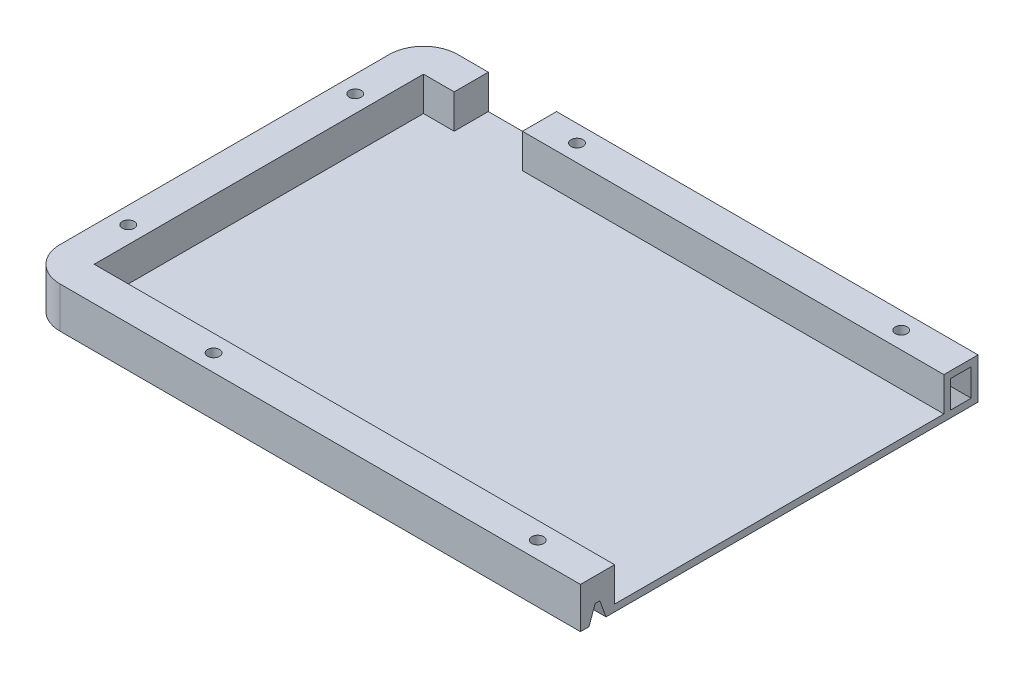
ISO-10303-21;
HEADER;
FILE_DESCRIPTION(('STEP AP214'),'2;1');
FILE_NAME('part.step','',(''),(''),'','','');
FILE_SCHEMA(('AUTOMOTIVE_DESIGN { 1 0 10303 214 1 1 1 1 }'));
ENDSEC;
DATA;
#1=APPLICATION_CONTEXT('core data for automotive mechanical design processes');
#2=APPLICATION_PROTOCOL_DEFINITION('international standard','automotive_design',2000,#1);
#3=PRODUCT_CONTEXT('',#1,'mechanical');
#4=PRODUCT('Part','Part','',(#3));
#5=PRODUCT_RELATED_PRODUCT_CATEGORY('part','',(#4));
#6=PRODUCT_DEFINITION_FORMATION('','',#4);
#7=PRODUCT_DEFINITION_CONTEXT('part definition',#1,'design');
#8=PRODUCT_DEFINITION('design','',#6,#7);
#9=PRODUCT_DEFINITION_SHAPE('','',#8);
#10=(LENGTH_UNIT() NAMED_UNIT(*) SI_UNIT(.MILLI.,.METRE.));
#11=(NAMED_UNIT(*) PLANE_ANGLE_UNIT() SI_UNIT($,.RADIAN.));
#12=(NAMED_UNIT(*) SI_UNIT($,.STERADIAN.) SOLID_ANGLE_UNIT());
#13=UNCERTAINTY_MEASURE_WITH_UNIT(LENGTH_MEASURE(1.E-05),#10,'distance_accuracy_value','');
#14=(GEOMETRIC_REPRESENTATION_CONTEXT(3) GLOBAL_UNCERTAINTY_ASSIGNED_CONTEXT((#13)) GLOBAL_UNIT_ASSIGNED_CONTEXT((#10,
#11,#12)) REPRESENTATION_CONTEXT('',''));
#15=CARTESIAN_POINT('',(0.,0.,0.));
#16=DIRECTION('',(0.,0.,1.));
#17=DIRECTION('',(1.,0.,0.));
#18=AXIS2_PLACEMENT_3D('',#15,#16,#17);
#19=CARTESIAN_POINT('',(162.5,2.,0.));
#20=DIRECTION('',(-1.,0.,0.));
#21=DIRECTION('',(0.,0.,1.));
#22=AXIS2_PLACEMENT_3D('',#19,#20,#21);
#23=PLANE('',#22);
#24=DIRECTION('',(0.,0.,1.));
#25=VECTOR('',#24,1.);
#26=CARTESIAN_POINT('',(162.5,5.,-2.49999999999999));
#27=LINE('',#26,#25);
#28=CARTESIAN_POINT('',(162.5,5.,-5.68014882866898));
#29=VERTEX_POINT('',#28);
#30=CARTESIAN_POINT('',(162.5,5.,-4.31985117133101));
#31=VERTEX_POINT('',#30);
#32=EDGE_CURVE('E437',#29,#31,#27,.T.);
#33=ORIENTED_EDGE('',*,*,#32,.F.);
#34=DIRECTION('',(0.,0.939692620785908,0.342020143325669));
#35=VECTOR('',#34,1.);
#36=CARTESIAN_POINT('',(162.5,4.1764979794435,-5.97987905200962));
#37=LINE('',#36,#35);
#38=CARTESIAN_POINT('',(162.5,0.,-7.5));
#39=VERTEX_POINT('',#38);
#40=EDGE_CURVE('E79',#29,#39,#37,.F.);
#41=ORIENTED_EDGE('',*,*,#40,.T.);
#42=DIRECTION('',(0.,0.,-1.));
#43=VECTOR('',#42,1.);
#44=CARTESIAN_POINT('',(162.5,0.,0.));
#45=LINE('',#44,#43);
#46=CARTESIAN_POINT('',(162.5,0.,-116.5));
#47=VERTEX_POINT('',#46);
#48=EDGE_CURVE('E366',#39,#47,#45,.T.);
#49=ORIENTED_EDGE('',*,*,#48,.T.);
#50=DIRECTION('',(0.,-1.,0.));
#51=VECTOR('',#50,1.);
#52=CARTESIAN_POINT('',(162.5,2.,-116.5));
#53=LINE('',#52,#51);
#54=CARTESIAN_POINT('',(162.5,12.,-116.5));
#55=VERTEX_POINT('',#54);
#56=EDGE_CURVE('E361',#55,#47,#53,.T.);
#57=ORIENTED_EDGE('',*,*,#56,.F.);
#58=DIRECTION('',(0.,0.,1.));
#59=VECTOR('',#58,1.);
#60=CARTESIAN_POINT('',(162.5,12.,-116.5));
#61=LINE('',#60,#59);
#62=CARTESIAN_POINT('',(162.5,12.,-106.5));
#63=VERTEX_POINT('',#62);
#64=EDGE_CURVE('E341',#55,#63,#61,.T.);
#65=ORIENTED_EDGE('',*,*,#64,.T.);
#66=DIRECTION('',(0.,-1.,0.));
#67=VECTOR('',#66,1.);
#68=CARTESIAN_POINT('',(162.5,12.,-106.5));
#69=LINE('',#68,#67);
#70=CARTESIAN_POINT('',(162.5,2.,-106.5));
#71=VERTEX_POINT('',#70);
#72=EDGE_CURVE('E344',#63,#71,#69,.T.);
#73=ORIENTED_EDGE('',*,*,#72,.T.);
#74=DIRECTION('',(0.,0.,-1.));
#75=VECTOR('',#74,1.);
#76=CARTESIAN_POINT('',(162.5,2.,0.));
#77=LINE('',#76,#75);
#78=CARTESIAN_POINT('',(162.5,2.,-10.));
#79=VERTEX_POINT('',#78);
#80=EDGE_CURVE('E356',#79,#71,#77,.T.);
#81=ORIENTED_EDGE('',*,*,#80,.F.);
#82=DIRECTION('',(0.,-1.,0.));
#83=VECTOR('',#82,1.);
#84=CARTESIAN_POINT('',(162.5,12.,-10.));
#85=LINE('',#84,#83);
#86=CARTESIAN_POINT('',(162.5,12.,-10.));
#87=VERTEX_POINT('',#86);
#88=EDGE_CURVE('E328',#87,#79,#85,.T.);
#89=ORIENTED_EDGE('',*,*,#88,.F.);
#90=DIRECTION('',(0.,0.,1.));
#91=VECTOR('',#90,1.);
#92=CARTESIAN_POINT('',(162.5,12.,-10.));
#93=LINE('',#92,#91);
#94=CARTESIAN_POINT('',(162.5,12.,0.));
#95=VERTEX_POINT('',#94);
#96=EDGE_CURVE('E288',#87,#95,#93,.T.);
#97=ORIENTED_EDGE('',*,*,#96,.T.);
#98=DIRECTION('',(0.,-1.,0.));
#99=VECTOR('',#98,1.);
#100=CARTESIAN_POINT('',(162.5,2.,0.));
#101=LINE('',#100,#99);
#102=CARTESIAN_POINT('',(162.5,0.,0.));
#103=VERTEX_POINT('',#102);
#104=EDGE_CURVE('E374',#95,#103,#101,.T.);
#105=ORIENTED_EDGE('',*,*,#104,.T.);
#106=CARTESIAN_POINT('',(162.5,0.,-2.5));
#107=VERTEX_POINT('',#106);
#108=EDGE_CURVE('E367',#103,#107,#45,.T.);
#109=ORIENTED_EDGE('',*,*,#108,.T.);
#110=DIRECTION('',(0.,0.939692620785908,-0.342020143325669));
#111=VECTOR('',#110,1.);
#112=CARTESIAN_POINT('',(162.5,0.,-2.49999999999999));
#113=LINE('',#112,#111);
#114=EDGE_CURVE('E94',#31,#107,#113,.F.);
#115=ORIENTED_EDGE('',*,*,#114,.F.);
#116=EDGE_LOOP('',(#33,#41,#49,#57,#65,#73,#81,#89,#97,#105,#109,#115));
#117=FACE_BOUND('',#116,.T.);
#118=DIRECTION('',(0.,-1.,0.));
#119=VECTOR('',#118,1.);
#120=CARTESIAN_POINT('',(162.5,0.,-114.5));
#121=LINE('',#120,#119);
#122=CARTESIAN_POINT('',(162.5,10.,-114.5));
#123=VERTEX_POINT('',#122);
#124=CARTESIAN_POINT('',(162.5,2.,-114.5));
#125=VERTEX_POINT('',#124);
#126=EDGE_CURVE('E251',#123,#125,#121,.T.);
#127=ORIENTED_EDGE('',*,*,#126,.T.);
#128=DIRECTION('',(0.,0.,-1.));
#129=VECTOR('',#128,1.);
#130=CARTESIAN_POINT('',(162.5,2.,0.));
#131=LINE('',#130,#129);
#132=CARTESIAN_POINT('',(162.5,2.,-108.5));
#133=VERTEX_POINT('',#132);
#134=EDGE_CURVE('E270',#133,#125,#131,.T.);
#135=ORIENTED_EDGE('',*,*,#134,.F.);
#136=DIRECTION('',(0.,-1.,0.));
#137=VECTOR('',#136,1.);
#138=CARTESIAN_POINT('',(162.5,0.,-108.5));
#139=LINE('',#138,#137);
#140=CARTESIAN_POINT('',(162.5,10.,-108.5));
#141=VERTEX_POINT('',#140);
#142=EDGE_CURVE('E273',#141,#133,#139,.T.);
#143=ORIENTED_EDGE('',*,*,#142,.F.);
#144=DIRECTION('',(0.,0.,-1.));
#145=VECTOR('',#144,1.);
#146=CARTESIAN_POINT('',(162.5,10.,0.));
#147=LINE('',#146,#145);
#148=EDGE_CURVE('E261',#141,#123,#147,.T.);
#149=ORIENTED_EDGE('',*,*,#148,.T.);
#150=EDGE_LOOP('',(#127,#135,#143,#149));
#151=FACE_BOUND('',#150,.T.);
#152=ADVANCED_FACE('F75',(#117,#151),#23,.F.);
#153=CARTESIAN_POINT('',(0.,2.,0.));
#154=DIRECTION('',(1.,0.,0.));
#155=DIRECTION('',(0.,0.,-1.));
#156=AXIS2_PLACEMENT_3D('',#153,#154,#155);
#157=PLANE('',#156);
#158=DIRECTION('',(0.,0.,1.));
#159=VECTOR('',#158,1.);
#160=CARTESIAN_POINT('',(0.,12.,-111.5));
#161=LINE('',#160,#159);
#162=CARTESIAN_POINT('',(0.,12.,-106.5));
#163=VERTEX_POINT('',#162);
#164=CARTESIAN_POINT('',(0.,12.,-9.99999999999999));
#165=VERTEX_POINT('',#164);
#166=EDGE_CURVE('E307',#163,#165,#161,.T.);
#167=ORIENTED_EDGE('',*,*,#166,.F.);
#168=DIRECTION('',(0.,-1.,0.));
#169=VECTOR('',#168,1.);
#170=CARTESIAN_POINT('',(0.,2.,-106.5));
#171=LINE('',#170,#169);
#172=CARTESIAN_POINT('',(0.,0.,-106.5));
#173=VERTEX_POINT('',#172);
#174=EDGE_CURVE('E379',#163,#173,#171,.T.);
#175=ORIENTED_EDGE('',*,*,#174,.T.);
#176=DIRECTION('',(0.,0.,1.));
#177=VECTOR('',#176,1.);
#178=CARTESIAN_POINT('',(0.,0.,0.));
#179=LINE('',#178,#177);
#180=CARTESIAN_POINT('',(0.,0.,-10.));
#181=VERTEX_POINT('',#180);
#182=EDGE_CURVE('E355',#173,#181,#179,.T.);
#183=ORIENTED_EDGE('',*,*,#182,.T.);
#184=DIRECTION('',(0.,-1.,0.));
#185=VECTOR('',#184,1.);
#186=CARTESIAN_POINT('',(0.,2.,-10.));
#187=LINE('',#186,#185);
#188=EDGE_CURVE('E377',#181,#165,#187,.F.);
#189=ORIENTED_EDGE('',*,*,#188,.T.);
#190=EDGE_LOOP('',(#167,#175,#183,#189));
#191=FACE_BOUND('',#190,.T.);
#192=ADVANCED_FACE('F556',(#191),#157,.F.);
#193=CARTESIAN_POINT('',(0.,2.,0.));
#194=DIRECTION('',(0.,0.,-1.));
#195=DIRECTION('',(-1.,0.,0.));
#196=AXIS2_PLACEMENT_3D('',#193,#194,#195);
#197=PLANE('',#196);
#198=DIRECTION('',(1.,0.,0.));
#199=VECTOR('',#198,1.);
#200=CARTESIAN_POINT('',(5.00000000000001,12.,0.));
#201=LINE('',#200,#199);
#202=CARTESIAN_POINT('',(10.,12.,0.));
#203=VERTEX_POINT('',#202);
#204=EDGE_CURVE('E286',#203,#95,#201,.T.);
#205=ORIENTED_EDGE('',*,*,#204,.F.);
#206=DIRECTION('',(0.,-1.,0.));
#207=VECTOR('',#206,1.);
#208=CARTESIAN_POINT('',(10.,2.,0.));
#209=LINE('',#208,#207);
#210=CARTESIAN_POINT('',(10.,0.,0.));
#211=VERTEX_POINT('',#210);
#212=EDGE_CURVE('E392',#203,#211,#209,.T.);
#213=ORIENTED_EDGE('',*,*,#212,.T.);
#214=DIRECTION('',(1.,0.,0.));
#215=VECTOR('',#214,1.);
#216=CARTESIAN_POINT('',(0.,0.,0.));
#217=LINE('',#216,#215);
#218=EDGE_CURVE('E364',#211,#103,#217,.T.);
#219=ORIENTED_EDGE('',*,*,#218,.T.);
#220=ORIENTED_EDGE('',*,*,#104,.F.);
#221=EDGE_LOOP('',(#205,#213,#219,#220));
#222=FACE_BOUND('',#221,.T.);
#223=ADVANCED_FACE('F561',(#222),#197,.F.);
#224=CARTESIAN_POINT('',(0.,2.,-116.5));
#225=DIRECTION('',(0.,0.,1.));
#226=DIRECTION('',(1.,0.,0.));
#227=AXIS2_PLACEMENT_3D('',#224,#225,#226);
#228=PLANE('',#227);
#229=DIRECTION('',(-1.,0.,0.));
#230=VECTOR('',#229,1.);
#231=CARTESIAN_POINT('',(0.,0.,-116.5));
#232=LINE('',#231,#230);
#233=CARTESIAN_POINT('',(10.,0.,-116.5));
#234=VERTEX_POINT('',#233);
#235=EDGE_CURVE('E359',#47,#234,#232,.T.);
#236=ORIENTED_EDGE('',*,*,#235,.T.);
#237=DIRECTION('',(0.,-1.,0.));
#238=VECTOR('',#237,1.);
#239=CARTESIAN_POINT('',(10.,2.,-116.5));
#240=LINE('',#239,#238);
#241=CARTESIAN_POINT('',(10.,12.,-116.5));
#242=VERTEX_POINT('',#241);
#243=EDGE_CURVE('E386',#234,#242,#240,.F.);
#244=ORIENTED_EDGE('',*,*,#243,.T.);
#245=DIRECTION('',(1.,0.,0.));
#246=VECTOR('',#245,1.);
#247=CARTESIAN_POINT('',(19.,12.,-116.5));
#248=LINE('',#247,#246);
#249=CARTESIAN_POINT('',(19.,12.,-116.5));
#250=VERTEX_POINT('',#249);
#251=EDGE_CURVE('E304',#250,#242,#248,.F.);
#252=ORIENTED_EDGE('',*,*,#251,.F.);
#253=DIRECTION('',(0.,-1.,0.));
#254=VECTOR('',#253,1.);
#255=CARTESIAN_POINT('',(19.,12.,-116.5));
#256=LINE('',#255,#254);
#257=CARTESIAN_POINT('',(19.,2.,-116.5));
#258=VERTEX_POINT('',#257);
#259=EDGE_CURVE('E310',#250,#258,#256,.T.);
#260=ORIENTED_EDGE('',*,*,#259,.T.);
#261=DIRECTION('',(-1.,0.,0.));
#262=VECTOR('',#261,1.);
#263=CARTESIAN_POINT('',(0.,2.,-116.5));
#264=LINE('',#263,#262);
#265=CARTESIAN_POINT('',(39.,2.,-116.5));
#266=VERTEX_POINT('',#265);
#267=EDGE_CURVE('E358',#266,#258,#264,.T.);
#268=ORIENTED_EDGE('',*,*,#267,.F.);
#269=DIRECTION('',(0.,-1.,0.));
#270=VECTOR('',#269,1.);
#271=CARTESIAN_POINT('',(39.,12.,-116.5));
#272=LINE('',#271,#270);
#273=CARTESIAN_POINT('',(39.,12.,-116.5));
#274=VERTEX_POINT('',#273);
#275=EDGE_CURVE('E353',#274,#266,#272,.T.);
#276=ORIENTED_EDGE('',*,*,#275,.F.);
#277=DIRECTION('',(-1.,0.,0.));
#278=VECTOR('',#277,1.);
#279=CARTESIAN_POINT('',(162.5,12.,-116.5));
#280=LINE('',#279,#278);
#281=EDGE_CURVE('E332',#55,#274,#280,.T.);
#282=ORIENTED_EDGE('',*,*,#281,.F.);
#283=ORIENTED_EDGE('',*,*,#56,.T.);
#284=EDGE_LOOP('',(#236,#244,#252,#260,#268,#276,#282,#283));
#285=FACE_BOUND('',#284,.T.);
#286=ADVANCED_FACE('F549',(#285),#228,.F.);
#287=CARTESIAN_POINT('',(0.,2.,0.));
#288=DIRECTION('',(0.,-1.,0.));
#289=DIRECTION('',(0.,0.,-1.));
#290=AXIS2_PLACEMENT_3D('',#287,#288,#289);
#291=PLANE('',#290);
#292=DIRECTION('',(0.,0.,1.));
#293=VECTOR('',#292,1.);
#294=CARTESIAN_POINT('',(10.,2.,-111.5));
#295=LINE('',#294,#293);
#296=CARTESIAN_POINT('',(10.,2.,-106.5));
#297=VERTEX_POINT('',#296);
#298=CARTESIAN_POINT('',(10.,2.,-10.));
#299=VERTEX_POINT('',#298);
#300=EDGE_CURVE('E312',#297,#299,#295,.T.);
#301=ORIENTED_EDGE('',*,*,#300,.T.);
#302=DIRECTION('',(1.,0.,0.));
#303=VECTOR('',#302,1.);
#304=CARTESIAN_POINT('',(5.00000000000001,2.,-10.));
#305=LINE('',#304,#303);
#306=EDGE_CURVE('E285',#299,#79,#305,.T.);
#307=ORIENTED_EDGE('',*,*,#306,.T.);
#308=ORIENTED_EDGE('',*,*,#80,.T.);
#309=DIRECTION('',(-1.,0.,0.));
#310=VECTOR('',#309,1.);
#311=CARTESIAN_POINT('',(162.5,2.,-106.5));
#312=LINE('',#311,#310);
#313=CARTESIAN_POINT('',(39.,2.,-106.5));
#314=VERTEX_POINT('',#313);
#315=EDGE_CURVE('E335',#71,#314,#312,.T.);
#316=ORIENTED_EDGE('',*,*,#315,.T.);
#317=DIRECTION('',(0.,0.,-1.));
#318=VECTOR('',#317,1.);
#319=CARTESIAN_POINT('',(39.,2.,-106.5));
#320=LINE('',#319,#318);
#321=EDGE_CURVE('E331',#314,#266,#320,.T.);
#322=ORIENTED_EDGE('',*,*,#321,.T.);
#323=ORIENTED_EDGE('',*,*,#267,.T.);
#324=DIRECTION('',(0.,0.,1.));
#325=VECTOR('',#324,1.);
#326=CARTESIAN_POINT('',(19.,2.,-116.5));
#327=LINE('',#326,#325);
#328=CARTESIAN_POINT('',(19.,2.,-106.5));
#329=VERTEX_POINT('',#328);
#330=EDGE_CURVE('E289',#258,#329,#327,.T.);
#331=ORIENTED_EDGE('',*,*,#330,.T.);
#332=DIRECTION('',(1.,0.,0.));
#333=VECTOR('',#332,1.);
#334=CARTESIAN_POINT('',(19.,2.,-106.5));
#335=LINE('',#334,#333);
#336=EDGE_CURVE('E314',#329,#297,#335,.F.);
#337=ORIENTED_EDGE('',*,*,#336,.T.);
#338=EDGE_LOOP('',(#301,#307,#308,#316,#322,#323,#331,#337));
#339=FACE_BOUND('',#338,.T.);
#340=ADVANCED_FACE('F539',(#339),#291,.F.);
#341=CARTESIAN_POINT('',(0.,0.,0.));
#342=DIRECTION('',(0.,-1.,0.));
#343=DIRECTION('',(0.,0.,-1.));
#344=AXIS2_PLACEMENT_3D('',#341,#342,#343);
#345=PLANE('',#344);
#346=DIRECTION('',(1.,0.,0.));
#347=VECTOR('',#346,1.);
#348=CARTESIAN_POINT('',(162.5,0.,-7.5));
#349=LINE('',#348,#347);
#350=CARTESIAN_POINT('',(150.,0.,-7.5));
#351=VERTEX_POINT('',#350);
#352=EDGE_CURVE('E444',#351,#39,#349,.T.);
#353=ORIENTED_EDGE('',*,*,#352,.F.);
#354=DIRECTION('',(0.,0.,-1.));
#355=VECTOR('',#354,1.);
#356=CARTESIAN_POINT('',(150.,0.,-2.5));
#357=LINE('',#356,#355);
#358=CARTESIAN_POINT('',(150.,0.,-2.5));
#359=VERTEX_POINT('',#358);
#360=EDGE_CURVE('E446',#359,#351,#357,.T.);
#361=ORIENTED_EDGE('',*,*,#360,.F.);
#362=DIRECTION('',(-1.,0.,0.));
#363=VECTOR('',#362,1.);
#364=CARTESIAN_POINT('',(162.5,0.,-2.49999999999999));
#365=LINE('',#364,#363);
#366=EDGE_CURVE('E449',#107,#359,#365,.T.);
#367=ORIENTED_EDGE('',*,*,#366,.F.);
#368=ORIENTED_EDGE('',*,*,#108,.F.);
#369=ORIENTED_EDGE('',*,*,#218,.F.);
#370=CARTESIAN_POINT('',(10.,0.,-10.));
#371=DIRECTION('',(0.,-1.,0.));
#372=DIRECTION('',(0.,0.,-1.));
#373=AXIS2_PLACEMENT_3D('',#370,#371,#372);
#374=CIRCLE('',#373,10.);
#375=EDGE_CURVE('E382',#211,#181,#374,.T.);
#376=ORIENTED_EDGE('',*,*,#375,.T.);
#377=ORIENTED_EDGE('',*,*,#182,.F.);
#378=CARTESIAN_POINT('',(10.,0.,-106.5));
#379=DIRECTION('',(0.,-1.,0.));
#380=DIRECTION('',(0.,0.,-1.));
#381=AXIS2_PLACEMENT_3D('',#378,#379,#380);
#382=CIRCLE('',#381,10.);
#383=EDGE_CURVE('E384',#173,#234,#382,.T.);
#384=ORIENTED_EDGE('',*,*,#383,.T.);
#385=ORIENTED_EDGE('',*,*,#235,.F.);
#386=ORIENTED_EDGE('',*,*,#48,.F.);
#387=EDGE_LOOP('',(#353,#361,#367,#368,#369,#376,#377,#384,#385,#386));
#388=FACE_BOUND('',#387,.T.);
#389=DIRECTION('',(0.,0.,1.));
#390=VECTOR('',#389,1.);
#391=CARTESIAN_POINT('',(137.5,0.,-114.));
#392=LINE('',#391,#390);
#393=CARTESIAN_POINT('',(137.5,0.,-114.));
#394=VERTEX_POINT('',#393);
#395=CARTESIAN_POINT('',(137.5,0.,-109.));
#396=VERTEX_POINT('',#395);
#397=EDGE_CURVE('E452',#394,#396,#392,.T.);
#398=ORIENTED_EDGE('',*,*,#397,.F.);
#399=DIRECTION('',(1.,0.,0.));
#400=VECTOR('',#399,1.);
#401=CARTESIAN_POINT('',(87.5,0.,-114.));
#402=LINE('',#401,#400);
#403=CARTESIAN_POINT('',(87.5,0.,-114.));
#404=VERTEX_POINT('',#403);
#405=EDGE_CURVE('E458',#404,#394,#402,.T.);
#406=ORIENTED_EDGE('',*,*,#405,.F.);
#407=DIRECTION('',(0.,0.,-1.));
#408=VECTOR('',#407,1.);
#409=CARTESIAN_POINT('',(87.5,0.,-114.));
#410=LINE('',#409,#408);
#411=CARTESIAN_POINT('',(87.5,0.,-109.));
#412=VERTEX_POINT('',#411);
#413=EDGE_CURVE('E456',#412,#404,#410,.T.);
#414=ORIENTED_EDGE('',*,*,#413,.F.);
#415=DIRECTION('',(-1.,0.,0.));
#416=VECTOR('',#415,1.);
#417=CARTESIAN_POINT('',(87.5,0.,-109.));
#418=LINE('',#417,#416);
#419=EDGE_CURVE('E454',#396,#412,#418,.T.);
#420=ORIENTED_EDGE('',*,*,#419,.F.);
#421=EDGE_LOOP('',(#398,#406,#414,#420));
#422=FACE_BOUND('',#421,.T.);
#423=CARTESIAN_POINT('',(5.00000000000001,0.,-91.5));
#424=DIRECTION('',(0.,-1.,0.));
#425=DIRECTION('',(0.,0.,1.));
#426=AXIS2_PLACEMENT_3D('',#423,#424,#425);
#427=CIRCLE('',#426,3.);
#428=CARTESIAN_POINT('',(5.00000000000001,0.,-88.5));
#429=VERTEX_POINT('',#428);
#430=EDGE_CURVE('E515',#429,#429,#427,.T.);
#431=ORIENTED_EDGE('',*,*,#430,.F.);
#432=EDGE_LOOP('',(#431));
#433=FACE_BOUND('',#432,.T.);
#434=CARTESIAN_POINT('',(50.,0.,-111.5));
#435=DIRECTION('',(0.,-1.,0.));
#436=DIRECTION('',(0.,0.,1.));
#437=AXIS2_PLACEMENT_3D('',#434,#435,#436);
#438=CIRCLE('',#437,2.99999999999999);
#439=CARTESIAN_POINT('',(50.,0.,-108.5));
#440=VERTEX_POINT('',#439);
#441=EDGE_CURVE('E527',#440,#440,#438,.T.);
#442=ORIENTED_EDGE('',*,*,#441,.F.);
#443=EDGE_LOOP('',(#442));
#444=FACE_BOUND('',#443,.T.);
#445=CARTESIAN_POINT('',(145.,0.,-111.5));
#446=DIRECTION('',(0.,-1.,0.));
#447=DIRECTION('',(0.,0.,1.));
#448=AXIS2_PLACEMENT_3D('',#445,#446,#447);
#449=CIRCLE('',#448,2.99999999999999);
#450=CARTESIAN_POINT('',(145.,0.,-108.5));
#451=VERTEX_POINT('',#450);
#452=EDGE_CURVE('E524',#451,#451,#449,.T.);
#453=ORIENTED_EDGE('',*,*,#452,.F.);
#454=EDGE_LOOP('',(#453));
#455=FACE_BOUND('',#454,.T.);
#456=CARTESIAN_POINT('',(145.,0.,-5.));
#457=DIRECTION('',(0.,-1.,0.));
#458=DIRECTION('',(0.,0.,-1.));
#459=AXIS2_PLACEMENT_3D('',#456,#457,#458);
#460=CIRCLE('',#459,2.99999999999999);
#461=CARTESIAN_POINT('',(145.,0.,-7.99999999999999));
#462=VERTEX_POINT('',#461);
#463=EDGE_CURVE('E521',#462,#462,#460,.T.);
#464=ORIENTED_EDGE('',*,*,#463,.F.);
#465=EDGE_LOOP('',(#464));
#466=FACE_BOUND('',#465,.T.);
#467=CARTESIAN_POINT('',(50.,0.,-5.));
#468=DIRECTION('',(0.,-1.,0.));
#469=DIRECTION('',(0.,0.,-1.));
#470=AXIS2_PLACEMENT_3D('',#467,#468,#469);
#471=CIRCLE('',#470,3.);
#472=CARTESIAN_POINT('',(50.,0.,-8.));
#473=VERTEX_POINT('',#472);
#474=EDGE_CURVE('E518',#473,#473,#471,.T.);
#475=ORIENTED_EDGE('',*,*,#474,.F.);
#476=EDGE_LOOP('',(#475));
#477=FACE_BOUND('',#476,.T.);
#478=CARTESIAN_POINT('',(5.00000000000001,0.,-25.));
#479=DIRECTION('',(0.,-1.,0.));
#480=DIRECTION('',(0.,0.,-1.));
#481=AXIS2_PLACEMENT_3D('',#478,#479,#480);
#482=CIRCLE('',#481,3.);
#483=CARTESIAN_POINT('',(5.00000000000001,0.,-28.));
#484=VERTEX_POINT('',#483);
#485=EDGE_CURVE('E262',#484,#484,#482,.T.);
#486=ORIENTED_EDGE('',*,*,#485,.F.);
#487=EDGE_LOOP('',(#486));
#488=FACE_BOUND('',#487,.T.);
#489=ADVANCED_FACE('F536',(#388,#422,#433,#444,#455,#466,#477,#488),#345,.T.);
#490=CARTESIAN_POINT('',(39.,12.,-106.5));
#491=DIRECTION('',(-1.,0.,0.));
#492=DIRECTION('',(0.,0.,1.));
#493=AXIS2_PLACEMENT_3D('',#490,#491,#492);
#494=PLANE('',#493);
#495=ORIENTED_EDGE('',*,*,#321,.F.);
#496=DIRECTION('',(0.,-1.,0.));
#497=VECTOR('',#496,1.);
#498=CARTESIAN_POINT('',(39.,12.,-106.5));
#499=LINE('',#498,#497);
#500=CARTESIAN_POINT('',(39.,12.,-106.5));
#501=VERTEX_POINT('',#500);
#502=EDGE_CURVE('E351',#501,#314,#499,.T.);
#503=ORIENTED_EDGE('',*,*,#502,.F.);
#504=DIRECTION('',(0.,0.,-1.));
#505=VECTOR('',#504,1.);
#506=CARTESIAN_POINT('',(39.,12.,-106.5));
#507=LINE('',#506,#505);
#508=EDGE_CURVE('E334',#501,#274,#507,.T.);
#509=ORIENTED_EDGE('',*,*,#508,.T.);
#510=ORIENTED_EDGE('',*,*,#275,.T.);
#511=EDGE_LOOP('',(#495,#503,#509,#510));
#512=FACE_BOUND('',#511,.T.);
#513=ADVANCED_FACE('F538',(#512),#494,.T.);
#514=CARTESIAN_POINT('',(162.5,12.,-106.5));
#515=DIRECTION('',(0.,0.,1.));
#516=DIRECTION('',(1.,0.,0.));
#517=AXIS2_PLACEMENT_3D('',#514,#515,#516);
#518=PLANE('',#517);
#519=ORIENTED_EDGE('',*,*,#315,.F.);
#520=ORIENTED_EDGE('',*,*,#72,.F.);
#521=DIRECTION('',(-1.,0.,0.));
#522=VECTOR('',#521,1.);
#523=CARTESIAN_POINT('',(162.5,12.,-106.5));
#524=LINE('',#523,#522);
#525=EDGE_CURVE('E338',#63,#501,#524,.T.);
#526=ORIENTED_EDGE('',*,*,#525,.T.);
#527=ORIENTED_EDGE('',*,*,#502,.T.);
#528=EDGE_LOOP('',(#519,#520,#526,#527));
#529=FACE_BOUND('',#528,.T.);
#530=ADVANCED_FACE('F546',(#529),#518,.T.);
#531=CARTESIAN_POINT('',(0.,12.,0.));
#532=DIRECTION('',(0.,-1.,0.));
#533=DIRECTION('',(-1.,0.,0.));
#534=AXIS2_PLACEMENT_3D('',#531,#532,#533);
#535=PLANE('',#534);
#536=CARTESIAN_POINT('',(50.,12.,-111.5));
#537=DIRECTION('',(0.,-1.,0.));
#538=DIRECTION('',(0.,0.,-1.));
#539=AXIS2_PLACEMENT_3D('',#536,#537,#538);
#540=CIRCLE('',#539,1.75);
#541=CARTESIAN_POINT('',(50.,12.,-113.25));
#542=VERTEX_POINT('',#541);
#543=EDGE_CURVE('E495',#542,#542,#540,.T.);
#544=ORIENTED_EDGE('',*,*,#543,.T.);
#545=EDGE_LOOP('',(#544));
#546=FACE_BOUND('',#545,.T.);
#547=CARTESIAN_POINT('',(145.,12.,-111.5));
#548=DIRECTION('',(0.,-1.,0.));
#549=DIRECTION('',(0.,0.,-1.));
#550=AXIS2_PLACEMENT_3D('',#547,#548,#549);
#551=CIRCLE('',#550,1.75000000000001);
#552=CARTESIAN_POINT('',(145.,12.,-113.25));
#553=VERTEX_POINT('',#552);
#554=EDGE_CURVE('E501',#553,#553,#551,.T.);
#555=ORIENTED_EDGE('',*,*,#554,.T.);
#556=EDGE_LOOP('',(#555));
#557=FACE_BOUND('',#556,.T.);
#558=ORIENTED_EDGE('',*,*,#281,.T.);
#559=ORIENTED_EDGE('',*,*,#508,.F.);
#560=ORIENTED_EDGE('',*,*,#525,.F.);
#561=ORIENTED_EDGE('',*,*,#64,.F.);
#562=EDGE_LOOP('',(#558,#559,#560,#561));
#563=FACE_BOUND('',#562,.T.);
#564=ADVANCED_FACE('F646',(#546,#557,#563),#535,.F.);
#565=CARTESIAN_POINT('',(5.00000000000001,12.,-10.));
#566=DIRECTION('',(0.,0.,-1.));
#567=DIRECTION('',(-1.,0.,0.));
#568=AXIS2_PLACEMENT_3D('',#565,#566,#567);
#569=PLANE('',#568);
#570=ORIENTED_EDGE('',*,*,#306,.F.);
#571=DIRECTION('',(0.,-1.,0.));
#572=VECTOR('',#571,1.);
#573=CARTESIAN_POINT('',(10.,12.,-10.));
#574=LINE('',#573,#572);
#575=CARTESIAN_POINT('',(10.,12.,-10.));
#576=VERTEX_POINT('',#575);
#577=EDGE_CURVE('E325',#576,#299,#574,.T.);
#578=ORIENTED_EDGE('',*,*,#577,.F.);
#579=DIRECTION('',(1.,0.,0.));
#580=VECTOR('',#579,1.);
#581=CARTESIAN_POINT('',(5.00000000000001,12.,-10.));
#582=LINE('',#581,#580);
#583=EDGE_CURVE('E292',#576,#87,#582,.T.);
#584=ORIENTED_EDGE('',*,*,#583,.T.);
#585=ORIENTED_EDGE('',*,*,#88,.T.);
#586=EDGE_LOOP('',(#570,#578,#584,#585));
#587=FACE_BOUND('',#586,.T.);
#588=ADVANCED_FACE('F654',(#587),#569,.T.);
#589=CARTESIAN_POINT('',(10.,12.,-111.5));
#590=DIRECTION('',(1.,0.,0.));
#591=DIRECTION('',(0.,0.,-1.));
#592=AXIS2_PLACEMENT_3D('',#589,#590,#591);
#593=PLANE('',#592);
#594=ORIENTED_EDGE('',*,*,#300,.F.);
#595=DIRECTION('',(0.,-1.,0.));
#596=VECTOR('',#595,1.);
#597=CARTESIAN_POINT('',(10.,12.,-106.5));
#598=LINE('',#597,#596);
#599=CARTESIAN_POINT('',(10.,12.,-106.5));
#600=VERTEX_POINT('',#599);
#601=EDGE_CURVE('E322',#600,#297,#598,.T.);
#602=ORIENTED_EDGE('',*,*,#601,.F.);
#603=DIRECTION('',(0.,0.,1.));
#604=VECTOR('',#603,1.);
#605=CARTESIAN_POINT('',(10.,12.,-111.5));
#606=LINE('',#605,#604);
#607=EDGE_CURVE('E295',#600,#576,#606,.T.);
#608=ORIENTED_EDGE('',*,*,#607,.T.);
#609=ORIENTED_EDGE('',*,*,#577,.T.);
#610=EDGE_LOOP('',(#594,#602,#608,#609));
#611=FACE_BOUND('',#610,.T.);
#612=ADVANCED_FACE('F679',(#611),#593,.T.);
#613=CARTESIAN_POINT('',(19.,12.,-106.5));
#614=DIRECTION('',(0.,0.,1.));
#615=DIRECTION('',(1.,0.,0.));
#616=AXIS2_PLACEMENT_3D('',#613,#614,#615);
#617=PLANE('',#616);
#618=ORIENTED_EDGE('',*,*,#336,.F.);
#619=DIRECTION('',(0.,-1.,0.));
#620=VECTOR('',#619,1.);
#621=CARTESIAN_POINT('',(19.,12.,-106.5));
#622=LINE('',#621,#620);
#623=CARTESIAN_POINT('',(19.,12.,-106.5));
#624=VERTEX_POINT('',#623);
#625=EDGE_CURVE('E319',#624,#329,#622,.T.);
#626=ORIENTED_EDGE('',*,*,#625,.F.);
#627=DIRECTION('',(1.,0.,0.));
#628=VECTOR('',#627,1.);
#629=CARTESIAN_POINT('',(19.,12.,-106.5));
#630=LINE('',#629,#628);
#631=EDGE_CURVE('E298',#624,#600,#630,.F.);
#632=ORIENTED_EDGE('',*,*,#631,.T.);
#633=ORIENTED_EDGE('',*,*,#601,.T.);
#634=EDGE_LOOP('',(#618,#626,#632,#633));
#635=FACE_BOUND('',#634,.T.);
#636=ADVANCED_FACE('F677',(#635),#617,.T.);
#637=CARTESIAN_POINT('',(19.,12.,-116.5));
#638=DIRECTION('',(1.,0.,0.));
#639=DIRECTION('',(0.,0.,-1.));
#640=AXIS2_PLACEMENT_3D('',#637,#638,#639);
#641=PLANE('',#640);
#642=ORIENTED_EDGE('',*,*,#330,.F.);
#643=ORIENTED_EDGE('',*,*,#259,.F.);
#644=DIRECTION('',(0.,0.,1.));
#645=VECTOR('',#644,1.);
#646=CARTESIAN_POINT('',(19.,12.,-116.5));
#647=LINE('',#646,#645);
#648=EDGE_CURVE('E301',#250,#624,#647,.T.);
#649=ORIENTED_EDGE('',*,*,#648,.T.);
#650=ORIENTED_EDGE('',*,*,#625,.T.);
#651=EDGE_LOOP('',(#642,#643,#649,#650));
#652=FACE_BOUND('',#651,.T.);
#653=ADVANCED_FACE('F674',(#652),#641,.T.);
#654=CARTESIAN_POINT('',(0.,12.,0.));
#655=DIRECTION('',(0.,-1.,0.));
#656=DIRECTION('',(-1.,0.,0.));
#657=AXIS2_PLACEMENT_3D('',#654,#655,#656);
#658=PLANE('',#657);
#659=CARTESIAN_POINT('',(5.00000000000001,12.,-91.5));
#660=DIRECTION('',(0.,-1.,0.));
#661=DIRECTION('',(0.,0.,-1.));
#662=AXIS2_PLACEMENT_3D('',#659,#660,#661);
#663=CIRCLE('',#662,1.75);
#664=CARTESIAN_POINT('',(5.00000000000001,12.,-93.25));
#665=VERTEX_POINT('',#664);
#666=EDGE_CURVE('E488',#665,#665,#663,.T.);
#667=ORIENTED_EDGE('',*,*,#666,.T.);
#668=EDGE_LOOP('',(#667));
#669=FACE_BOUND('',#668,.T.);
#670=CARTESIAN_POINT('',(145.,12.,-5.));
#671=DIRECTION('',(0.,-1.,0.));
#672=DIRECTION('',(0.,0.,-1.));
#673=AXIS2_PLACEMENT_3D('',#670,#671,#672);
#674=CIRCLE('',#673,1.75000000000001);
#675=CARTESIAN_POINT('',(145.,12.,-6.75000000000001));
#676=VERTEX_POINT('',#675);
#677=EDGE_CURVE('E507',#676,#676,#674,.T.);
#678=ORIENTED_EDGE('',*,*,#677,.T.);
#679=EDGE_LOOP('',(#678));
#680=FACE_BOUND('',#679,.T.);
#681=CARTESIAN_POINT('',(50.,12.,-5.));
#682=DIRECTION('',(0.,-1.,0.));
#683=DIRECTION('',(0.,0.,-1.));
#684=AXIS2_PLACEMENT_3D('',#681,#682,#683);
#685=CIRCLE('',#684,1.75);
#686=CARTESIAN_POINT('',(50.,12.,-6.75));
#687=VERTEX_POINT('',#686);
#688=EDGE_CURVE('E482',#687,#687,#685,.T.);
#689=ORIENTED_EDGE('',*,*,#688,.T.);
#690=EDGE_LOOP('',(#689));
#691=FACE_BOUND('',#690,.T.);
#692=CARTESIAN_POINT('',(5.00000000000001,12.,-25.));
#693=DIRECTION('',(0.,-1.,0.));
#694=DIRECTION('',(0.,0.,-1.));
#695=AXIS2_PLACEMENT_3D('',#692,#693,#694);
#696=CIRCLE('',#695,1.75);
#697=CARTESIAN_POINT('',(5.00000000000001,12.,-26.75));
#698=VERTEX_POINT('',#697);
#699=EDGE_CURVE('E512',#698,#698,#696,.T.);
#700=ORIENTED_EDGE('',*,*,#699,.T.);
#701=EDGE_LOOP('',(#700));
#702=FACE_BOUND('',#701,.T.);
#703=ORIENTED_EDGE('',*,*,#251,.T.);
#704=CARTESIAN_POINT('',(10.,12.,-106.5));
#705=DIRECTION('',(0.,-1.,0.));
#706=DIRECTION('',(0.,0.,-1.));
#707=AXIS2_PLACEMENT_3D('',#704,#705,#706);
#708=CIRCLE('',#707,10.);
#709=EDGE_CURVE('E390',#242,#163,#708,.F.);
#710=ORIENTED_EDGE('',*,*,#709,.T.);
#711=ORIENTED_EDGE('',*,*,#166,.T.);
#712=CARTESIAN_POINT('',(10.,12.,-10.));
#713=DIRECTION('',(0.,-1.,0.));
#714=DIRECTION('',(0.,0.,-1.));
#715=AXIS2_PLACEMENT_3D('',#712,#713,#714);
#716=CIRCLE('',#715,10.);
#717=EDGE_CURVE('E388',#165,#203,#716,.F.);
#718=ORIENTED_EDGE('',*,*,#717,.T.);
#719=ORIENTED_EDGE('',*,*,#204,.T.);
#720=ORIENTED_EDGE('',*,*,#96,.F.);
#721=ORIENTED_EDGE('',*,*,#583,.F.);
#722=ORIENTED_EDGE('',*,*,#607,.F.);
#723=ORIENTED_EDGE('',*,*,#631,.F.);
#724=ORIENTED_EDGE('',*,*,#648,.F.);
#725=EDGE_LOOP('',(#703,#710,#711,#718,#719,#720,#721,#722,#723,#724));
#726=FACE_BOUND('',#725,.T.);
#727=ADVANCED_FACE('F572',(#669,#680,#691,#702,#726),#658,.F.);
#728=CARTESIAN_POINT('',(10.,2.,-106.5));
#729=DIRECTION('',(0.,-1.,0.));
#730=DIRECTION('',(0.,0.,-1.));
#731=AXIS2_PLACEMENT_3D('',#728,#729,#730);
#732=CYLINDRICAL_SURFACE('',#731,10.);
#733=ORIENTED_EDGE('',*,*,#709,.F.);
#734=ORIENTED_EDGE('',*,*,#243,.F.);
#735=ORIENTED_EDGE('',*,*,#383,.F.);
#736=ORIENTED_EDGE('',*,*,#174,.F.);
#737=EDGE_LOOP('',(#733,#734,#735,#736));
#738=FACE_BOUND('',#737,.T.);
#739=ADVANCED_FACE('F568',(#738),#732,.T.);
#740=CARTESIAN_POINT('',(10.,2.,-10.));
#741=DIRECTION('',(0.,-1.,0.));
#742=DIRECTION('',(0.,0.,-1.));
#743=AXIS2_PLACEMENT_3D('',#740,#741,#742);
#744=CYLINDRICAL_SURFACE('',#743,10.);
#745=ORIENTED_EDGE('',*,*,#717,.F.);
#746=ORIENTED_EDGE('',*,*,#188,.F.);
#747=ORIENTED_EDGE('',*,*,#375,.F.);
#748=ORIENTED_EDGE('',*,*,#212,.F.);
#749=EDGE_LOOP('',(#745,#746,#747,#748));
#750=FACE_BOUND('',#749,.T.);
#751=ADVANCED_FACE('F571',(#750),#744,.T.);
#752=CARTESIAN_POINT('',(162.5,0.,-114.5));
#753=DIRECTION('',(-0.707106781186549,0.,-0.707106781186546));
#754=DIRECTION('',(-0.707106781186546,0.,0.707106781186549));
#755=AXIS2_PLACEMENT_3D('',#752,#753,#754);
#756=PLANE('',#755);
#757=DIRECTION('',(-0.577350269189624,0.577350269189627,0.577350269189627));
#758=VECTOR('',#757,1.);
#759=CARTESIAN_POINT('',(163.166666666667,1.33333333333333,-115.166666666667));
#760=LINE('',#759,#758);
#761=CARTESIAN_POINT('',(159.5,5.,-111.5));
#762=VERTEX_POINT('',#761);
#763=EDGE_CURVE('E256',#762,#125,#760,.F.);
#764=ORIENTED_EDGE('',*,*,#763,.T.);
#765=ORIENTED_EDGE('',*,*,#126,.F.);
#766=DIRECTION('',(0.577350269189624,0.577350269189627,-0.577350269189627));
#767=VECTOR('',#766,1.);
#768=CARTESIAN_POINT('',(159.166666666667,6.66666666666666,-111.166666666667));
#769=LINE('',#768,#767);
#770=CARTESIAN_POINT('',(159.5,6.99999999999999,-111.5));
#771=VERTEX_POINT('',#770);
#772=EDGE_CURVE('E254',#771,#123,#769,.T.);
#773=ORIENTED_EDGE('',*,*,#772,.F.);
#774=DIRECTION('',(0.,-1.,0.));
#775=VECTOR('',#774,1.);
#776=CARTESIAN_POINT('',(159.5,0.,-111.5));
#777=LINE('',#776,#775);
#778=EDGE_CURVE('E279',#762,#771,#777,.F.);
#779=ORIENTED_EDGE('',*,*,#778,.F.);
#780=EDGE_LOOP('',(#764,#765,#773,#779));
#781=FACE_BOUND('',#780,.T.);
#782=ADVANCED_FACE('F253',(#781),#756,.F.);
#783=CARTESIAN_POINT('',(162.5,2.,0.));
#784=DIRECTION('',(-0.707106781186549,-0.707106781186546,0.));
#785=DIRECTION('',(0.707106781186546,-0.707106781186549,0.));
#786=AXIS2_PLACEMENT_3D('',#783,#784,#785);
#787=PLANE('',#786);
#788=ORIENTED_EDGE('',*,*,#134,.T.);
#789=ORIENTED_EDGE('',*,*,#763,.F.);
#790=DIRECTION('',(0.577350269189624,-0.577350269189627,0.577350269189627));
#791=VECTOR('',#790,1.);
#792=CARTESIAN_POINT('',(163.166666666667,1.33333333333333,-107.833333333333));
#793=LINE('',#792,#791);
#794=EDGE_CURVE('E280',#762,#133,#793,.T.);
#795=ORIENTED_EDGE('',*,*,#794,.T.);
#796=EDGE_LOOP('',(#788,#789,#795));
#797=FACE_BOUND('',#796,.T.);
#798=ADVANCED_FACE('F773',(#797),#787,.F.);
#799=CARTESIAN_POINT('',(162.5,0.,-108.5));
#800=DIRECTION('',(-0.707106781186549,0.,0.707106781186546));
#801=DIRECTION('',(0.707106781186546,0.,0.707106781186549));
#802=AXIS2_PLACEMENT_3D('',#799,#800,#801);
#803=PLANE('',#802);
#804=ORIENTED_EDGE('',*,*,#778,.T.);
#805=DIRECTION('',(-0.577350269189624,-0.577350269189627,-0.577350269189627));
#806=VECTOR('',#805,1.);
#807=CARTESIAN_POINT('',(159.166666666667,6.66666666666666,-111.833333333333));
#808=LINE('',#807,#806);
#809=EDGE_CURVE('E269',#771,#141,#808,.F.);
#810=ORIENTED_EDGE('',*,*,#809,.T.);
#811=ORIENTED_EDGE('',*,*,#142,.T.);
#812=ORIENTED_EDGE('',*,*,#794,.F.);
#813=EDGE_LOOP('',(#804,#810,#811,#812));
#814=FACE_BOUND('',#813,.T.);
#815=ADVANCED_FACE('F783',(#814),#803,.F.);
#816=CARTESIAN_POINT('',(162.5,10.,0.));
#817=DIRECTION('',(-0.707106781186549,0.707106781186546,0.));
#818=DIRECTION('',(-0.707106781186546,-0.707106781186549,0.));
#819=AXIS2_PLACEMENT_3D('',#816,#817,#818);
#820=PLANE('',#819);
#821=ORIENTED_EDGE('',*,*,#148,.F.);
#822=ORIENTED_EDGE('',*,*,#809,.F.);
#823=ORIENTED_EDGE('',*,*,#772,.T.);
#824=EDGE_LOOP('',(#821,#822,#823));
#825=FACE_BOUND('',#824,.T.);
#826=ADVANCED_FACE('F267',(#825),#820,.F.);
#827=CARTESIAN_POINT('',(5.00000000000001,9.,-25.));
#828=DIRECTION('',(0.,-1.,0.));
#829=DIRECTION('',(0.,0.,-1.));
#830=AXIS2_PLACEMENT_3D('',#827,#828,#829);
#831=CYLINDRICAL_SURFACE('',#830,3.);
#832=CARTESIAN_POINT('',(5.00000000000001,8.24999999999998,-25.));
#833=DIRECTION('',(0.,-1.,0.));
#834=DIRECTION('',(0.,0.,-1.));
#835=AXIS2_PLACEMENT_3D('',#832,#833,#834);
#836=CIRCLE('',#835,3.);
#837=CARTESIAN_POINT('',(5.00000000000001,8.24999999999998,-28.));
#838=VERTEX_POINT('',#837);
#839=EDGE_CURVE('E398',#838,#838,#836,.F.);
#840=ORIENTED_EDGE('',*,*,#839,.T.);
#841=EDGE_LOOP('',(#840));
#842=FACE_BOUND('',#841,.T.);
#843=ORIENTED_EDGE('',*,*,#485,.T.);
#844=EDGE_LOOP('',(#843));
#845=FACE_BOUND('',#844,.T.);
#846=ADVANCED_FACE('F534',(#842,#845),#831,.F.);
#847=CARTESIAN_POINT('',(5.00000000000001,9.,-25.));
#848=DIRECTION('',(0.,-1.,0.));
#849=DIRECTION('',(0.,0.,-1.));
#850=AXIS2_PLACEMENT_3D('',#847,#848,#849);
#851=PLANE('',#850);
#852=CARTESIAN_POINT('',(5.00000000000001,9.,-25.));
#853=DIRECTION('',(0.,-1.,0.));
#854=DIRECTION('',(0.,0.,-1.));
#855=AXIS2_PLACEMENT_3D('',#852,#853,#854);
#856=CIRCLE('',#855,2.24999999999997);
#857=CARTESIAN_POINT('',(5.00000000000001,9.,-27.25));
#858=VERTEX_POINT('',#857);
#859=EDGE_CURVE('E395',#858,#858,#856,.T.);
#860=ORIENTED_EDGE('',*,*,#859,.T.);
#861=EDGE_LOOP('',(#860));
#862=FACE_BOUND('',#861,.T.);
#863=CARTESIAN_POINT('',(5.00000000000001,9.,-25.));
#864=DIRECTION('',(0.,-1.,0.));
#865=DIRECTION('',(0.,0.,-1.));
#866=AXIS2_PLACEMENT_3D('',#863,#864,#865);
#867=CIRCLE('',#866,1.75);
#868=CARTESIAN_POINT('',(5.00000000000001,9.,-26.75));
#869=VERTEX_POINT('',#868);
#870=EDGE_CURVE('E491',#869,#869,#867,.T.);
#871=ORIENTED_EDGE('',*,*,#870,.F.);
#872=EDGE_LOOP('',(#871));
#873=FACE_BOUND('',#872,.T.);
#874=ADVANCED_FACE('F809',(#862,#873),#851,.T.);
#875=CARTESIAN_POINT('',(50.,9.,-5.));
#876=DIRECTION('',(0.,-1.,0.));
#877=DIRECTION('',(0.,0.,-1.));
#878=AXIS2_PLACEMENT_3D('',#875,#876,#877);
#879=CYLINDRICAL_SURFACE('',#878,3.);
#880=CARTESIAN_POINT('',(50.,8.24999999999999,-5.));
#881=DIRECTION('',(0.,-1.,0.));
#882=DIRECTION('',(0.,0.,-1.));
#883=AXIS2_PLACEMENT_3D('',#880,#881,#882);
#884=CIRCLE('',#883,3.);
#885=CARTESIAN_POINT('',(50.,8.24999999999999,-8.));
#886=VERTEX_POINT('',#885);
#887=EDGE_CURVE('E12',#886,#886,#884,.F.);
#888=ORIENTED_EDGE('',*,*,#887,.T.);
#889=EDGE_LOOP('',(#888));
#890=FACE_BOUND('',#889,.T.);
#891=ORIENTED_EDGE('',*,*,#474,.T.);
#892=EDGE_LOOP('',(#891));
#893=FACE_BOUND('',#892,.T.);
#894=ADVANCED_FACE('F817',(#890,#893),#879,.F.);
#895=CARTESIAN_POINT('',(50.,9.,-5.));
#896=DIRECTION('',(0.,-1.,0.));
#897=DIRECTION('',(0.,0.,-1.));
#898=AXIS2_PLACEMENT_3D('',#895,#896,#897);
#899=PLANE('',#898);
#900=CARTESIAN_POINT('',(50.,9.,-5.));
#901=DIRECTION('',(0.,-1.,0.));
#902=DIRECTION('',(0.,0.,-1.));
#903=AXIS2_PLACEMENT_3D('',#900,#901,#902);
#904=CIRCLE('',#903,2.25);
#905=CARTESIAN_POINT('',(50.,9.,-7.25));
#906=VERTEX_POINT('',#905);
#907=EDGE_CURVE('E85',#906,#906,#904,.T.);
#908=ORIENTED_EDGE('',*,*,#907,.T.);
#909=EDGE_LOOP('',(#908));
#910=FACE_BOUND('',#909,.T.);
#911=CARTESIAN_POINT('',(50.,9.,-5.));
#912=DIRECTION('',(0.,-1.,0.));
#913=DIRECTION('',(0.,0.,-1.));
#914=AXIS2_PLACEMENT_3D('',#911,#912,#913);
#915=CIRCLE('',#914,1.75);
#916=CARTESIAN_POINT('',(50.,9.,-6.75));
#917=VERTEX_POINT('',#916);
#918=EDGE_CURVE('E464',#917,#917,#915,.T.);
#919=ORIENTED_EDGE('',*,*,#918,.F.);
#920=EDGE_LOOP('',(#919));
#921=FACE_BOUND('',#920,.T.);
#922=ADVANCED_FACE('F825',(#910,#921),#899,.T.);
#923=CARTESIAN_POINT('',(145.,9.,-5.));
#924=DIRECTION('',(0.,-1.,0.));
#925=DIRECTION('',(0.,0.,-1.));
#926=AXIS2_PLACEMENT_3D('',#923,#924,#925);
#927=CYLINDRICAL_SURFACE('',#926,2.99999999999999);
#928=CARTESIAN_POINT('',(145.,8.25,-5.));
#929=DIRECTION('',(0.,-1.,0.));
#930=DIRECTION('',(0.,0.,-1.));
#931=AXIS2_PLACEMENT_3D('',#928,#929,#930);
#932=CIRCLE('',#931,2.99999999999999);
#933=CARTESIAN_POINT('',(145.,8.25,-7.99999999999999));
#934=VERTEX_POINT('',#933);
#935=EDGE_CURVE('E422',#934,#934,#932,.F.);
#936=ORIENTED_EDGE('',*,*,#935,.T.);
#937=EDGE_LOOP('',(#936));
#938=FACE_BOUND('',#937,.T.);
#939=ORIENTED_EDGE('',*,*,#463,.T.);
#940=EDGE_LOOP('',(#939));
#941=FACE_BOUND('',#940,.T.);
#942=ADVANCED_FACE('F833',(#938,#941),#927,.F.);
#943=CARTESIAN_POINT('',(145.,9.,-5.));
#944=DIRECTION('',(0.,-1.,0.));
#945=DIRECTION('',(0.,0.,-1.));
#946=AXIS2_PLACEMENT_3D('',#943,#944,#945);
#947=PLANE('',#946);
#948=CARTESIAN_POINT('',(145.,9.,-5.));
#949=DIRECTION('',(0.,-1.,0.));
#950=DIRECTION('',(0.,0.,-1.));
#951=AXIS2_PLACEMENT_3D('',#948,#949,#950);
#952=CIRCLE('',#951,2.25);
#953=CARTESIAN_POINT('',(145.,9.,-7.25));
#954=VERTEX_POINT('',#953);
#955=EDGE_CURVE('E419',#954,#954,#952,.T.);
#956=ORIENTED_EDGE('',*,*,#955,.T.);
#957=EDGE_LOOP('',(#956));
#958=FACE_BOUND('',#957,.T.);
#959=CARTESIAN_POINT('',(145.,9.,-5.));
#960=DIRECTION('',(0.,-1.,0.));
#961=DIRECTION('',(0.,0.,-1.));
#962=AXIS2_PLACEMENT_3D('',#959,#960,#961);
#963=CIRCLE('',#962,1.75000000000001);
#964=CARTESIAN_POINT('',(145.,9.,-6.75000000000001));
#965=VERTEX_POINT('',#964);
#966=EDGE_CURVE('E485',#965,#965,#963,.T.);
#967=ORIENTED_EDGE('',*,*,#966,.F.);
#968=EDGE_LOOP('',(#967));
#969=FACE_BOUND('',#968,.T.);
#970=ADVANCED_FACE('F841',(#958,#969),#947,.T.);
#971=CARTESIAN_POINT('',(145.,9.,-111.5));
#972=DIRECTION('',(0.,-1.,0.));
#973=DIRECTION('',(0.,0.,-1.));
#974=AXIS2_PLACEMENT_3D('',#971,#972,#973);
#975=CYLINDRICAL_SURFACE('',#974,2.99999999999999);
#976=CARTESIAN_POINT('',(145.,8.24999999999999,-111.5));
#977=DIRECTION('',(0.,1.,0.));
#978=DIRECTION('',(0.,0.,1.));
#979=AXIS2_PLACEMENT_3D('',#976,#977,#978);
#980=CIRCLE('',#979,2.99999999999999);
#981=CARTESIAN_POINT('',(145.,8.24999999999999,-114.5));
#982=VERTEX_POINT('',#981);
#983=EDGE_CURVE('E416',#982,#982,#980,.T.);
#984=ORIENTED_EDGE('',*,*,#983,.T.);
#985=EDGE_LOOP('',(#984));
#986=FACE_BOUND('',#985,.T.);
#987=ORIENTED_EDGE('',*,*,#452,.T.);
#988=EDGE_LOOP('',(#987));
#989=FACE_BOUND('',#988,.T.);
#990=ADVANCED_FACE('F849',(#986,#989),#975,.F.);
#991=CARTESIAN_POINT('',(145.,9.,-111.5));
#992=DIRECTION('',(0.,1.,0.));
#993=DIRECTION('',(0.,0.,1.));
#994=AXIS2_PLACEMENT_3D('',#991,#992,#993);
#995=PLANE('',#994);
#996=CARTESIAN_POINT('',(145.,9.,-111.5));
#997=DIRECTION('',(0.,1.,0.));
#998=DIRECTION('',(0.,0.,1.));
#999=AXIS2_PLACEMENT_3D('',#996,#997,#998);
#1000=CIRCLE('',#999,2.24999999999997);
#1001=CARTESIAN_POINT('',(145.,9.,-113.75));
#1002=VERTEX_POINT('',#1001);
#1003=EDGE_CURVE('E413',#1002,#1002,#1000,.F.);
#1004=ORIENTED_EDGE('',*,*,#1003,.T.);
#1005=EDGE_LOOP('',(#1004));
#1006=FACE_BOUND('',#1005,.T.);
#1007=CARTESIAN_POINT('',(145.,9.,-111.5));
#1008=DIRECTION('',(0.,-1.,0.));
#1009=DIRECTION('',(0.,0.,-1.));
#1010=AXIS2_PLACEMENT_3D('',#1007,#1008,#1009);
#1011=CIRCLE('',#1010,1.75000000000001);
#1012=CARTESIAN_POINT('',(145.,9.,-113.25));
#1013=VERTEX_POINT('',#1012);
#1014=EDGE_CURVE('E504',#1013,#1013,#1011,.T.);
#1015=ORIENTED_EDGE('',*,*,#1014,.F.);
#1016=EDGE_LOOP('',(#1015));
#1017=FACE_BOUND('',#1016,.T.);
#1018=ADVANCED_FACE('F857',(#1006,#1017),#995,.F.);
#1019=CARTESIAN_POINT('',(50.,9.,-111.5));
#1020=DIRECTION('',(0.,-1.,0.));
#1021=DIRECTION('',(0.,0.,-1.));
#1022=AXIS2_PLACEMENT_3D('',#1019,#1020,#1021);
#1023=CYLINDRICAL_SURFACE('',#1022,2.99999999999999);
#1024=CARTESIAN_POINT('',(50.,8.25000000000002,-111.5));
#1025=DIRECTION('',(0.,1.,0.));
#1026=DIRECTION('',(0.,0.,1.));
#1027=AXIS2_PLACEMENT_3D('',#1024,#1025,#1026);
#1028=CIRCLE('',#1027,2.99999999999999);
#1029=CARTESIAN_POINT('',(50.,8.25000000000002,-114.5));
#1030=VERTEX_POINT('',#1029);
#1031=EDGE_CURVE('E410',#1030,#1030,#1028,.T.);
#1032=ORIENTED_EDGE('',*,*,#1031,.T.);
#1033=EDGE_LOOP('',(#1032));
#1034=FACE_BOUND('',#1033,.T.);
#1035=ORIENTED_EDGE('',*,*,#441,.T.);
#1036=EDGE_LOOP('',(#1035));
#1037=FACE_BOUND('',#1036,.T.);
#1038=ADVANCED_FACE('F865',(#1034,#1037),#1023,.F.);
#1039=CARTESIAN_POINT('',(50.,9.,-111.5));
#1040=DIRECTION('',(0.,1.,0.));
#1041=DIRECTION('',(0.,0.,1.));
#1042=AXIS2_PLACEMENT_3D('',#1039,#1040,#1041);
#1043=PLANE('',#1042);
#1044=CARTESIAN_POINT('',(50.,9.,-111.5));
#1045=DIRECTION('',(0.,1.,0.));
#1046=DIRECTION('',(0.,0.,1.));
#1047=AXIS2_PLACEMENT_3D('',#1044,#1045,#1046);
#1048=CIRCLE('',#1047,2.25);
#1049=CARTESIAN_POINT('',(50.,9.,-113.75));
#1050=VERTEX_POINT('',#1049);
#1051=EDGE_CURVE('E407',#1050,#1050,#1048,.F.);
#1052=ORIENTED_EDGE('',*,*,#1051,.T.);
#1053=EDGE_LOOP('',(#1052));
#1054=FACE_BOUND('',#1053,.T.);
#1055=CARTESIAN_POINT('',(50.,9.,-111.5));
#1056=DIRECTION('',(0.,-1.,0.));
#1057=DIRECTION('',(0.,0.,-1.));
#1058=AXIS2_PLACEMENT_3D('',#1055,#1056,#1057);
#1059=CIRCLE('',#1058,1.75);
#1060=CARTESIAN_POINT('',(50.,9.,-113.25));
#1061=VERTEX_POINT('',#1060);
#1062=EDGE_CURVE('E498',#1061,#1061,#1059,.T.);
#1063=ORIENTED_EDGE('',*,*,#1062,.F.);
#1064=EDGE_LOOP('',(#1063));
#1065=FACE_BOUND('',#1064,.T.);
#1066=ADVANCED_FACE('F873',(#1054,#1065),#1043,.F.);
#1067=CARTESIAN_POINT('',(5.00000000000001,9.,-91.5));
#1068=DIRECTION('',(0.,-1.,0.));
#1069=DIRECTION('',(0.,0.,-1.));
#1070=AXIS2_PLACEMENT_3D('',#1067,#1068,#1069);
#1071=CYLINDRICAL_SURFACE('',#1070,3.);
#1072=CARTESIAN_POINT('',(5.00000000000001,8.25000000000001,-91.5));
#1073=DIRECTION('',(0.,1.,0.));
#1074=DIRECTION('',(0.,0.,1.));
#1075=AXIS2_PLACEMENT_3D('',#1072,#1073,#1074);
#1076=CIRCLE('',#1075,3.);
#1077=CARTESIAN_POINT('',(5.00000000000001,8.25000000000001,-88.5));
#1078=VERTEX_POINT('',#1077);
#1079=EDGE_CURVE('E404',#1078,#1078,#1076,.T.);
#1080=ORIENTED_EDGE('',*,*,#1079,.T.);
#1081=EDGE_LOOP('',(#1080));
#1082=FACE_BOUND('',#1081,.T.);
#1083=ORIENTED_EDGE('',*,*,#430,.T.);
#1084=EDGE_LOOP('',(#1083));
#1085=FACE_BOUND('',#1084,.T.);
#1086=ADVANCED_FACE('F881',(#1082,#1085),#1071,.F.);
#1087=CARTESIAN_POINT('',(5.00000000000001,9.,-91.5));
#1088=DIRECTION('',(0.,1.,0.));
#1089=DIRECTION('',(0.,0.,1.));
#1090=AXIS2_PLACEMENT_3D('',#1087,#1088,#1089);
#1091=PLANE('',#1090);
#1092=CARTESIAN_POINT('',(5.00000000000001,9.,-91.5));
#1093=DIRECTION('',(0.,1.,0.));
#1094=DIRECTION('',(0.,0.,1.));
#1095=AXIS2_PLACEMENT_3D('',#1092,#1093,#1094);
#1096=CIRCLE('',#1095,2.25);
#1097=CARTESIAN_POINT('',(5.00000000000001,9.,-89.25));
#1098=VERTEX_POINT('',#1097);
#1099=EDGE_CURVE('E401',#1098,#1098,#1096,.F.);
#1100=ORIENTED_EDGE('',*,*,#1099,.T.);
#1101=EDGE_LOOP('',(#1100));
#1102=FACE_BOUND('',#1101,.T.);
#1103=CARTESIAN_POINT('',(5.00000000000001,9.,-91.5));
#1104=DIRECTION('',(0.,-1.,0.));
#1105=DIRECTION('',(0.,0.,-1.));
#1106=AXIS2_PLACEMENT_3D('',#1103,#1104,#1105);
#1107=CIRCLE('',#1106,1.75);
#1108=CARTESIAN_POINT('',(5.00000000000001,9.,-93.25));
#1109=VERTEX_POINT('',#1108);
#1110=EDGE_CURVE('E492',#1109,#1109,#1107,.T.);
#1111=ORIENTED_EDGE('',*,*,#1110,.F.);
#1112=EDGE_LOOP('',(#1111));
#1113=FACE_BOUND('',#1112,.T.);
#1114=ADVANCED_FACE('F889',(#1102,#1113),#1091,.F.);
#1115=CARTESIAN_POINT('',(5.00000000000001,12.,-25.));
#1116=DIRECTION('',(0.,-1.,0.));
#1117=DIRECTION('',(0.,0.,-1.));
#1118=AXIS2_PLACEMENT_3D('',#1115,#1116,#1117);
#1119=CYLINDRICAL_SURFACE('',#1118,1.75);
#1120=ORIENTED_EDGE('',*,*,#699,.F.);
#1121=EDGE_LOOP('',(#1120));
#1122=FACE_BOUND('',#1121,.T.);
#1123=ORIENTED_EDGE('',*,*,#870,.T.);
#1124=EDGE_LOOP('',(#1123));
#1125=FACE_BOUND('',#1124,.T.);
#1126=ADVANCED_FACE('F897',(#1122,#1125),#1119,.F.);
#1127=CARTESIAN_POINT('',(50.,12.,-5.));
#1128=DIRECTION('',(0.,-1.,0.));
#1129=DIRECTION('',(0.,0.,-1.));
#1130=AXIS2_PLACEMENT_3D('',#1127,#1128,#1129);
#1131=CYLINDRICAL_SURFACE('',#1130,1.75);
#1132=ORIENTED_EDGE('',*,*,#688,.F.);
#1133=EDGE_LOOP('',(#1132));
#1134=FACE_BOUND('',#1133,.T.);
#1135=ORIENTED_EDGE('',*,*,#918,.T.);
#1136=EDGE_LOOP('',(#1135));
#1137=FACE_BOUND('',#1136,.T.);
#1138=ADVANCED_FACE('F906',(#1134,#1137),#1131,.F.);
#1139=CARTESIAN_POINT('',(145.,12.,-5.));
#1140=DIRECTION('',(0.,-1.,0.));
#1141=DIRECTION('',(0.,0.,-1.));
#1142=AXIS2_PLACEMENT_3D('',#1139,#1140,#1141);
#1143=CYLINDRICAL_SURFACE('',#1142,1.75000000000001);
#1144=ORIENTED_EDGE('',*,*,#677,.F.);
#1145=EDGE_LOOP('',(#1144));
#1146=FACE_BOUND('',#1145,.T.);
#1147=ORIENTED_EDGE('',*,*,#966,.T.);
#1148=EDGE_LOOP('',(#1147));
#1149=FACE_BOUND('',#1148,.T.);
#1150=ADVANCED_FACE('F914',(#1146,#1149),#1143,.F.);
#1151=CARTESIAN_POINT('',(5.00000000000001,12.,-91.5));
#1152=DIRECTION('',(0.,-1.,0.));
#1153=DIRECTION('',(0.,0.,-1.));
#1154=AXIS2_PLACEMENT_3D('',#1151,#1152,#1153);
#1155=CYLINDRICAL_SURFACE('',#1154,1.75);
#1156=ORIENTED_EDGE('',*,*,#666,.F.);
#1157=EDGE_LOOP('',(#1156));
#1158=FACE_BOUND('',#1157,.T.);
#1159=ORIENTED_EDGE('',*,*,#1110,.T.);
#1160=EDGE_LOOP('',(#1159));
#1161=FACE_BOUND('',#1160,.T.);
#1162=ADVANCED_FACE('F922',(#1158,#1161),#1155,.F.);
#1163=CARTESIAN_POINT('',(145.,12.,-111.5));
#1164=DIRECTION('',(0.,-1.,0.));
#1165=DIRECTION('',(0.,0.,-1.));
#1166=AXIS2_PLACEMENT_3D('',#1163,#1164,#1165);
#1167=CYLINDRICAL_SURFACE('',#1166,1.75000000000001);
#1168=ORIENTED_EDGE('',*,*,#554,.F.);
#1169=EDGE_LOOP('',(#1168));
#1170=FACE_BOUND('',#1169,.T.);
#1171=ORIENTED_EDGE('',*,*,#1014,.T.);
#1172=EDGE_LOOP('',(#1171));
#1173=FACE_BOUND('',#1172,.T.);
#1174=ADVANCED_FACE('F930',(#1170,#1173),#1167,.F.);
#1175=CARTESIAN_POINT('',(50.,12.,-111.5));
#1176=DIRECTION('',(0.,-1.,0.));
#1177=DIRECTION('',(0.,0.,-1.));
#1178=AXIS2_PLACEMENT_3D('',#1175,#1176,#1177);
#1179=CYLINDRICAL_SURFACE('',#1178,1.75);
#1180=ORIENTED_EDGE('',*,*,#543,.F.);
#1181=EDGE_LOOP('',(#1180));
#1182=FACE_BOUND('',#1181,.T.);
#1183=ORIENTED_EDGE('',*,*,#1062,.T.);
#1184=EDGE_LOOP('',(#1183));
#1185=FACE_BOUND('',#1184,.T.);
#1186=ADVANCED_FACE('F585',(#1182,#1185),#1179,.F.);
#1187=CARTESIAN_POINT('',(5.00000000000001,9.,-25.));
#1188=DIRECTION('',(0.,-1.,0.));
#1189=DIRECTION('',(0.,0.,-1.));
#1190=AXIS2_PLACEMENT_3D('',#1187,#1188,#1189);
#1191=CONICAL_SURFACE('',#1190,2.24999999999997,0.785398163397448);
#1192=ORIENTED_EDGE('',*,*,#839,.F.);
#1193=EDGE_LOOP('',(#1192));
#1194=FACE_BOUND('',#1193,.T.);
#1195=ORIENTED_EDGE('',*,*,#859,.F.);
#1196=EDGE_LOOP('',(#1195));
#1197=FACE_BOUND('',#1196,.T.);
#1198=ADVANCED_FACE('F578',(#1194,#1197),#1191,.F.);
#1199=CARTESIAN_POINT('',(5.00000000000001,9.,-91.5));
#1200=DIRECTION('',(0.,-1.,0.));
#1201=DIRECTION('',(0.,0.,-1.));
#1202=AXIS2_PLACEMENT_3D('',#1199,#1200,#1201);
#1203=CONICAL_SURFACE('',#1202,2.25,0.785398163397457);
#1204=ORIENTED_EDGE('',*,*,#1079,.F.);
#1205=EDGE_LOOP('',(#1204));
#1206=FACE_BOUND('',#1205,.T.);
#1207=ORIENTED_EDGE('',*,*,#1099,.F.);
#1208=EDGE_LOOP('',(#1207));
#1209=FACE_BOUND('',#1208,.T.);
#1210=ADVANCED_FACE('F584',(#1206,#1209),#1203,.F.);
#1211=CARTESIAN_POINT('',(50.,9.,-111.5));
#1212=DIRECTION('',(0.,-1.,0.));
#1213=DIRECTION('',(0.,0.,-1.));
#1214=AXIS2_PLACEMENT_3D('',#1211,#1212,#1213);
#1215=CONICAL_SURFACE('',#1214,2.25,0.785398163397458);
#1216=CARTESIAN_POINT('',(50.,8.25000000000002,-114.5));
#1217=CARTESIAN_POINT('',(50.,8.25781250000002,-114.4921875));
#1218=CARTESIAN_POINT('',(50.,8.26562500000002,-114.484375));
#1219=CARTESIAN_POINT('',(50.,8.28125000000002,-114.46875));
#1220=CARTESIAN_POINT('',(50.,8.28906250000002,-114.4609375));
#1221=CARTESIAN_POINT('',(50.,8.30468750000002,-114.4453125));
#1222=CARTESIAN_POINT('',(50.,8.31250000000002,-114.4375));
#1223=CARTESIAN_POINT('',(50.,8.32812500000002,-114.421875));
#1224=CARTESIAN_POINT('',(50.,8.33593750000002,-114.4140625));
#1225=CARTESIAN_POINT('',(50.,8.35156250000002,-114.3984375));
#1226=CARTESIAN_POINT('',(50.,8.35937500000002,-114.390625));
#1227=CARTESIAN_POINT('',(50.,8.37500000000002,-114.375));
#1228=CARTESIAN_POINT('',(50.,8.38281250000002,-114.3671875));
#1229=CARTESIAN_POINT('',(50.,8.39843750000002,-114.3515625));
#1230=CARTESIAN_POINT('',(50.,8.40625000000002,-114.34375));
#1231=CARTESIAN_POINT('',(50.,8.42187500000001,-114.328125));
#1232=CARTESIAN_POINT('',(50.,8.42968750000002,-114.3203125));
#1233=CARTESIAN_POINT('',(50.,8.44531250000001,-114.3046875));
#1234=CARTESIAN_POINT('',(50.,8.45312500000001,-114.296875));
#1235=CARTESIAN_POINT('',(50.,8.46875000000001,-114.28125));
#1236=CARTESIAN_POINT('',(50.,8.47656250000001,-114.2734375));
#1237=CARTESIAN_POINT('',(50.,8.49218750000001,-114.2578125));
#1238=CARTESIAN_POINT('',(50.,8.50000000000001,-114.25));
#1239=CARTESIAN_POINT('',(50.,8.51562500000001,-114.234375));
#1240=CARTESIAN_POINT('',(50.,8.52343750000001,-114.2265625));
#1241=CARTESIAN_POINT('',(50.,8.53906250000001,-114.2109375));
#1242=CARTESIAN_POINT('',(50.,8.54687500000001,-114.203125));
#1243=CARTESIAN_POINT('',(50.,8.56250000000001,-114.1875));
#1244=CARTESIAN_POINT('',(50.,8.57031250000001,-114.1796875));
#1245=CARTESIAN_POINT('',(50.,8.58593750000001,-114.1640625));
#1246=CARTESIAN_POINT('',(50.,8.59375000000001,-114.15625));
#1247=CARTESIAN_POINT('',(50.,8.60937500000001,-114.140625));
#1248=CARTESIAN_POINT('',(50.,8.61718750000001,-114.1328125));
#1249=CARTESIAN_POINT('',(50.,8.63281250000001,-114.1171875));
#1250=CARTESIAN_POINT('',(50.,8.64062500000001,-114.109375));
#1251=CARTESIAN_POINT('',(50.,8.65625000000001,-114.09375));
#1252=CARTESIAN_POINT('',(50.,8.66406250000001,-114.0859375));
#1253=CARTESIAN_POINT('',(50.,8.67968750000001,-114.0703125));
#1254=CARTESIAN_POINT('',(50.,8.68750000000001,-114.0625));
#1255=CARTESIAN_POINT('',(50.,8.70312500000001,-114.046875));
#1256=CARTESIAN_POINT('',(50.,8.71093750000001,-114.0390625));
#1257=CARTESIAN_POINT('',(50.,8.72656250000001,-114.0234375));
#1258=CARTESIAN_POINT('',(50.,8.73437500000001,-114.015625));
#1259=CARTESIAN_POINT('',(50.,8.75000000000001,-114.));
#1260=CARTESIAN_POINT('',(50.,8.75781250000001,-113.9921875));
#1261=CARTESIAN_POINT('',(50.,8.77343750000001,-113.9765625));
#1262=CARTESIAN_POINT('',(50.,8.78125000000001,-113.96875));
#1263=CARTESIAN_POINT('',(50.,8.796875,-113.953125));
#1264=CARTESIAN_POINT('',(50.,8.8046875,-113.9453125));
#1265=CARTESIAN_POINT('',(50.,8.8203125,-113.9296875));
#1266=CARTESIAN_POINT('',(50.,8.828125,-113.921875));
#1267=CARTESIAN_POINT('',(50.,8.84375,-113.90625));
#1268=CARTESIAN_POINT('',(50.,8.8515625,-113.8984375));
#1269=CARTESIAN_POINT('',(50.,8.8671875,-113.8828125));
#1270=CARTESIAN_POINT('',(50.,8.875,-113.875));
#1271=CARTESIAN_POINT('',(50.,8.890625,-113.859375));
#1272=CARTESIAN_POINT('',(50.,8.8984375,-113.8515625));
#1273=CARTESIAN_POINT('',(50.,8.9140625,-113.8359375));
#1274=CARTESIAN_POINT('',(50.,8.921875,-113.828125));
#1275=CARTESIAN_POINT('',(50.,8.9375,-113.8125));
#1276=CARTESIAN_POINT('',(50.,8.9453125,-113.8046875));
#1277=CARTESIAN_POINT('',(50.,8.9609375,-113.7890625));
#1278=CARTESIAN_POINT('',(50.,8.96875,-113.78125));
#1279=CARTESIAN_POINT('',(50.,8.984375,-113.765625));
#1280=CARTESIAN_POINT('',(50.,8.9921875,-113.7578125));
#1281=CARTESIAN_POINT('',(50.,9.,-113.75));
#1282=B_SPLINE_CURVE_WITH_KNOTS('',3,(#1216,#1217,#1218,#1219,#1220,#1221,#1222,#1223,#1224,
#1225,#1226,#1227,#1228,#1229,#1230,#1231,#1232,#1233,#1234,#1235,#1236,#1237,#1238,#1239,#1240,
#1241,#1242,#1243,#1244,#1245,#1246,#1247,#1248,#1249,#1250,#1251,#1252,#1253,#1254,#1255,#1256,
#1257,#1258,#1259,#1260,#1261,#1262,#1263,#1264,#1265,#1266,#1267,#1268,#1269,#1270,#1271,#1272,
#1273,#1274,#1275,#1276,#1277,#1278,#1279,#1280,#1281),.UNSPECIFIED.,.F.,.F.,(4,2,2,2,2,2,2,2,2,
2,2,2,2,2,2,2,2,2,2,2,2,2,2,2,2,2,2,2,2,2,2,2,4),(0.,0.0331456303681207,0.0662912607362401,
0.0994368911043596,0.132582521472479,0.165728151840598,0.198873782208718,0.232019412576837,
0.265165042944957,0.298310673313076,0.331456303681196,0.364601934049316,0.397747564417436,
0.430893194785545,0.464038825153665,0.497184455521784,0.530330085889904,0.563475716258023,
0.596621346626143,0.629766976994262,0.662912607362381,0.696058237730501,0.729203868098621,
0.762349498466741,0.79549512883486,0.82864075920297,0.861786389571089,0.894932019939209,
0.928077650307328,0.961223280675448,0.994368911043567,1.02751454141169,1.06066017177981),.UNSPECIFIED.);
#1283=EDGE_CURVE('BSEAM592',#1030,#1050,#1282,.T.);
#1284=ORIENTED_EDGE('',*,*,#1031,.F.);
#1285=ORIENTED_EDGE('',*,*,#1051,.F.);
#1286=ORIENTED_EDGE('',*,*,#1283,.T.);
#1287=ORIENTED_EDGE('',*,*,#1283,.F.);
#1288=EDGE_LOOP('',(#1284,#1286,#1285,#1287));
#1289=FACE_BOUND('',#1288,.T.);
#1290=ADVANCED_FACE('F592',(#1289),#1215,.F.);
#1291=CARTESIAN_POINT('',(145.,9.,-111.5));
#1292=DIRECTION('',(0.,-1.,0.));
#1293=DIRECTION('',(0.,0.,-1.));
#1294=AXIS2_PLACEMENT_3D('',#1291,#1292,#1293);
#1295=CONICAL_SURFACE('',#1294,2.24999999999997,0.785398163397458);
#1296=CARTESIAN_POINT('',(145.,8.24999999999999,-114.5));
#1297=CARTESIAN_POINT('',(145.,8.25781249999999,-114.4921875));
#1298=CARTESIAN_POINT('',(145.,8.26562499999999,-114.484375));
#1299=CARTESIAN_POINT('',(145.,8.28124999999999,-114.46875));
#1300=CARTESIAN_POINT('',(145.,8.28906249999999,-114.4609375));
#1301=CARTESIAN_POINT('',(145.,8.30468749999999,-114.4453125));
#1302=CARTESIAN_POINT('',(145.,8.31249999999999,-114.4375));
#1303=CARTESIAN_POINT('',(145.,8.32812499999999,-114.421875));
#1304=CARTESIAN_POINT('',(145.,8.33593749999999,-114.4140625));
#1305=CARTESIAN_POINT('',(145.,8.35156249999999,-114.3984375));
#1306=CARTESIAN_POINT('',(145.,8.35937499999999,-114.390625));
#1307=CARTESIAN_POINT('',(145.,8.37499999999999,-114.375));
#1308=CARTESIAN_POINT('',(145.,8.38281249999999,-114.3671875));
#1309=CARTESIAN_POINT('',(145.,8.39843749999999,-114.3515625));
#1310=CARTESIAN_POINT('',(145.,8.40624999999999,-114.34375));
#1311=CARTESIAN_POINT('',(145.,8.42187499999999,-114.328125));
#1312=CARTESIAN_POINT('',(145.,8.42968749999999,-114.3203125));
#1313=CARTESIAN_POINT('',(145.,8.44531249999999,-114.3046875));
#1314=CARTESIAN_POINT('',(145.,8.45312499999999,-114.296875));
#1315=CARTESIAN_POINT('',(145.,8.46874999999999,-114.28125));
#1316=CARTESIAN_POINT('',(145.,8.47656249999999,-114.2734375));
#1317=CARTESIAN_POINT('',(145.,8.49218749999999,-114.2578125));
#1318=CARTESIAN_POINT('',(145.,8.49999999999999,-114.25));
#1319=CARTESIAN_POINT('',(145.,8.51562499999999,-114.234375));
#1320=CARTESIAN_POINT('',(145.,8.52343749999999,-114.2265625));
#1321=CARTESIAN_POINT('',(145.,8.53906249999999,-114.2109375));
#1322=CARTESIAN_POINT('',(145.,8.54687499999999,-114.203125));
#1323=CARTESIAN_POINT('',(145.,8.56249999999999,-114.1875));
#1324=CARTESIAN_POINT('',(145.,8.57031249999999,-114.1796875));
#1325=CARTESIAN_POINT('',(145.,8.58593749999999,-114.1640625));
#1326=CARTESIAN_POINT('',(145.,8.59374999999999,-114.15625));
#1327=CARTESIAN_POINT('',(145.,8.60937499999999,-114.140625));
#1328=CARTESIAN_POINT('',(145.,8.61718749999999,-114.1328125));
#1329=CARTESIAN_POINT('',(145.,8.6328125,-114.1171875));
#1330=CARTESIAN_POINT('',(145.,8.64062499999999,-114.109375));
#1331=CARTESIAN_POINT('',(145.,8.65624999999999,-114.09375));
#1332=CARTESIAN_POINT('',(145.,8.6640625,-114.0859375));
#1333=CARTESIAN_POINT('',(145.,8.6796875,-114.0703125));
#1334=CARTESIAN_POINT('',(145.,8.6875,-114.0625));
#1335=CARTESIAN_POINT('',(145.,8.703125,-114.046875));
#1336=CARTESIAN_POINT('',(145.,8.7109375,-114.0390625));
#1337=CARTESIAN_POINT('',(145.,8.7265625,-114.0234375));
#1338=CARTESIAN_POINT('',(145.,8.734375,-114.015625));
#1339=CARTESIAN_POINT('',(145.,8.75,-114.));
#1340=CARTESIAN_POINT('',(145.,8.7578125,-113.9921875));
#1341=CARTESIAN_POINT('',(145.,8.7734375,-113.9765625));
#1342=CARTESIAN_POINT('',(145.,8.78125,-113.96875));
#1343=CARTESIAN_POINT('',(145.,8.796875,-113.953125));
#1344=CARTESIAN_POINT('',(145.,8.8046875,-113.9453125));
#1345=CARTESIAN_POINT('',(145.,8.8203125,-113.9296875));
#1346=CARTESIAN_POINT('',(145.,8.828125,-113.921875));
#1347=CARTESIAN_POINT('',(145.,8.84375,-113.90625));
#1348=CARTESIAN_POINT('',(145.,8.8515625,-113.8984375));
#1349=CARTESIAN_POINT('',(145.,8.8671875,-113.8828125));
#1350=CARTESIAN_POINT('',(145.,8.875,-113.875));
#1351=CARTESIAN_POINT('',(145.,8.890625,-113.859375));
#1352=CARTESIAN_POINT('',(145.,8.8984375,-113.8515625));
#1353=CARTESIAN_POINT('',(145.,8.9140625,-113.8359375));
#1354=CARTESIAN_POINT('',(145.,8.921875,-113.828125));
#1355=CARTESIAN_POINT('',(145.,8.9375,-113.8125));
#1356=CARTESIAN_POINT('',(145.,8.9453125,-113.8046875));
#1357=CARTESIAN_POINT('',(145.,8.9609375,-113.7890625));
#1358=CARTESIAN_POINT('',(145.,8.96875,-113.78125));
#1359=CARTESIAN_POINT('',(145.,8.984375,-113.765625));
#1360=CARTESIAN_POINT('',(145.,8.9921875,-113.7578125));
#1361=CARTESIAN_POINT('',(145.,9.,-113.75));
#1362=B_SPLINE_CURVE_WITH_KNOTS('',3,(#1296,#1297,#1298,#1299,#1300,#1301,#1302,#1303,#1304,
#1305,#1306,#1307,#1308,#1309,#1310,#1311,#1312,#1313,#1314,#1315,#1316,#1317,#1318,#1319,#1320,
#1321,#1322,#1323,#1324,#1325,#1326,#1327,#1328,#1329,#1330,#1331,#1332,#1333,#1334,#1335,#1336,
#1337,#1338,#1339,#1340,#1341,#1342,#1343,#1344,#1345,#1346,#1347,#1348,#1349,#1350,#1351,#1352,
#1353,#1354,#1355,#1356,#1357,#1358,#1359,#1360,#1361),.UNSPECIFIED.,.F.,.F.,(4,2,2,2,2,2,2,2,2,
2,2,2,2,2,2,2,2,2,2,2,2,2,2,2,2,2,2,2,2,2,2,2,4),(0.,0.0331456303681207,0.0662912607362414,
0.0994368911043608,0.132582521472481,0.165728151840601,0.198873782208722,0.232019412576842,
0.265165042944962,0.298310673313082,0.331456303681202,0.364601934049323,0.397747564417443,
0.430893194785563,0.464038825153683,0.497184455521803,0.530330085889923,0.563475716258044,
0.596621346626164,0.629766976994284,0.662912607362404,0.696058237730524,0.729203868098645,
0.762349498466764,0.795495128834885,0.828640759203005,0.861786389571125,0.894932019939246,
0.928077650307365,0.961223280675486,0.994368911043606,1.02751454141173,1.06066017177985),.UNSPECIFIED.);
#1363=EDGE_CURVE('BSEAM599',#982,#1002,#1362,.T.);
#1364=ORIENTED_EDGE('',*,*,#983,.F.);
#1365=ORIENTED_EDGE('',*,*,#1003,.F.);
#1366=ORIENTED_EDGE('',*,*,#1363,.T.);
#1367=ORIENTED_EDGE('',*,*,#1363,.F.);
#1368=EDGE_LOOP('',(#1364,#1366,#1365,#1367));
#1369=FACE_BOUND('',#1368,.T.);
#1370=ADVANCED_FACE('F599',(#1369),#1295,.F.);
#1371=CARTESIAN_POINT('',(145.,9.,-5.));
#1372=DIRECTION('',(0.,-1.,0.));
#1373=DIRECTION('',(0.,0.,-1.));
#1374=AXIS2_PLACEMENT_3D('',#1371,#1372,#1373);
#1375=CONICAL_SURFACE('',#1374,2.25,0.785398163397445);
#1376=ORIENTED_EDGE('',*,*,#935,.F.);
#1377=EDGE_LOOP('',(#1376));
#1378=FACE_BOUND('',#1377,.T.);
#1379=ORIENTED_EDGE('',*,*,#955,.F.);
#1380=EDGE_LOOP('',(#1379));
#1381=FACE_BOUND('',#1380,.T.);
#1382=ADVANCED_FACE('F606',(#1378,#1381),#1375,.F.);
#1383=CARTESIAN_POINT('',(50.,9.,-5.));
#1384=DIRECTION('',(0.,-1.,0.));
#1385=DIRECTION('',(0.,0.,-1.));
#1386=AXIS2_PLACEMENT_3D('',#1383,#1384,#1385);
#1387=CONICAL_SURFACE('',#1386,2.25,0.785398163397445);
#1388=ORIENTED_EDGE('',*,*,#887,.F.);
#1389=EDGE_LOOP('',(#1388));
#1390=FACE_BOUND('',#1389,.T.);
#1391=ORIENTED_EDGE('',*,*,#907,.F.);
#1392=EDGE_LOOP('',(#1391));
#1393=FACE_BOUND('',#1392,.T.);
#1394=ADVANCED_FACE('F613',(#1390,#1393),#1387,.F.);
#1395=CARTESIAN_POINT('',(137.5,0.,-114.));
#1396=DIRECTION('',(0.939692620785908,0.342020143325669,0.));
#1397=DIRECTION('',(-0.342020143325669,0.939692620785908,0.));
#1398=AXIS2_PLACEMENT_3D('',#1395,#1396,#1397);
#1399=PLANE('',#1398);
#1400=ORIENTED_EDGE('',*,*,#397,.T.);
#1401=DIRECTION('',(0.323615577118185,-0.889126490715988,0.323615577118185));
#1402=VECTOR('',#1401,1.);
#1403=CARTESIAN_POINT('',(136.976364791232,1.4386759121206,-109.523635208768));
#1404=LINE('',#1403,#1402);
#1405=CARTESIAN_POINT('',(135.680148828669,5.,-110.819851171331));
#1406=VERTEX_POINT('',#1405);
#1407=EDGE_CURVE('E466',#1406,#396,#1404,.T.);
#1408=ORIENTED_EDGE('',*,*,#1407,.F.);
#1409=DIRECTION('',(0.,0.,1.));
#1410=VECTOR('',#1409,1.);
#1411=CARTESIAN_POINT('',(135.680148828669,5.,-114.));
#1412=LINE('',#1411,#1410);
#1413=CARTESIAN_POINT('',(135.680148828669,5.,-112.180148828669));
#1414=VERTEX_POINT('',#1413);
#1415=EDGE_CURVE('E461',#1414,#1406,#1412,.T.);
#1416=ORIENTED_EDGE('',*,*,#1415,.F.);
#1417=DIRECTION('',(0.323615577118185,-0.889126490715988,-0.323615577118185));
#1418=VECTOR('',#1417,1.);
#1419=CARTESIAN_POINT('',(132.263647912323,14.386759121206,-108.763647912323));
#1420=LINE('',#1419,#1418);
#1421=EDGE_CURVE('E462',#1414,#394,#1420,.T.);
#1422=ORIENTED_EDGE('',*,*,#1421,.T.);
#1423=EDGE_LOOP('',(#1400,#1408,#1416,#1422));
#1424=FACE_BOUND('',#1423,.T.);
#1425=ADVANCED_FACE('F619',(#1424),#1399,.F.);
#1426=CARTESIAN_POINT('',(87.5,0.,-114.));
#1427=DIRECTION('',(0.,0.342020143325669,-0.939692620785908));
#1428=DIRECTION('',(0.,0.939692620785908,0.342020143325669));
#1429=AXIS2_PLACEMENT_3D('',#1426,#1427,#1428);
#1430=PLANE('',#1429);
#1431=ORIENTED_EDGE('',*,*,#405,.T.);
#1432=ORIENTED_EDGE('',*,*,#1421,.F.);
#1433=DIRECTION('',(1.,0.,0.));
#1434=VECTOR('',#1433,1.);
#1435=CARTESIAN_POINT('',(87.5,5.,-112.180148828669));
#1436=LINE('',#1435,#1434);
#1437=CARTESIAN_POINT('',(89.319851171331,5.,-112.180148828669));
#1438=VERTEX_POINT('',#1437);
#1439=EDGE_CURVE('E469',#1438,#1414,#1436,.T.);
#1440=ORIENTED_EDGE('',*,*,#1439,.F.);
#1441=DIRECTION('',(-0.323615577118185,-0.889126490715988,-0.323615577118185));
#1442=VECTOR('',#1441,1.);
#1443=CARTESIAN_POINT('',(87.5,0.,-114.));
#1444=LINE('',#1443,#1442);
#1445=EDGE_CURVE('E465',#1438,#404,#1444,.T.);
#1446=ORIENTED_EDGE('',*,*,#1445,.T.);
#1447=EDGE_LOOP('',(#1431,#1432,#1440,#1446));
#1448=FACE_BOUND('',#1447,.T.);
#1449=ADVANCED_FACE('F974',(#1448),#1430,.F.);
#1450=CARTESIAN_POINT('',(87.5,0.,-114.));
#1451=DIRECTION('',(-0.939692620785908,0.342020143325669,0.));
#1452=DIRECTION('',(-0.342020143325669,-0.939692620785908,0.));
#1453=AXIS2_PLACEMENT_3D('',#1450,#1451,#1452);
#1454=PLANE('',#1453);
#1455=ORIENTED_EDGE('',*,*,#413,.T.);
#1456=ORIENTED_EDGE('',*,*,#1445,.F.);
#1457=DIRECTION('',(0.,0.,-1.));
#1458=VECTOR('',#1457,1.);
#1459=CARTESIAN_POINT('',(89.319851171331,5.,-114.));
#1460=LINE('',#1459,#1458);
#1461=CARTESIAN_POINT('',(89.319851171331,5.,-110.819851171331));
#1462=VERTEX_POINT('',#1461);
#1463=EDGE_CURVE('E477',#1462,#1438,#1460,.T.);
#1464=ORIENTED_EDGE('',*,*,#1463,.F.);
#1465=DIRECTION('',(-0.323615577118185,-0.889126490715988,0.323615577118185));
#1466=VECTOR('',#1465,1.);
#1467=CARTESIAN_POINT('',(87.5,0.,-109.));
#1468=LINE('',#1467,#1466);
#1469=EDGE_CURVE('E128',#1462,#412,#1468,.T.);
#1470=ORIENTED_EDGE('',*,*,#1469,.T.);
#1471=EDGE_LOOP('',(#1455,#1456,#1464,#1470));
#1472=FACE_BOUND('',#1471,.T.);
#1473=ADVANCED_FACE('F982',(#1472),#1454,.F.);
#1474=CARTESIAN_POINT('',(87.5,0.,-109.));
#1475=DIRECTION('',(0.,0.342020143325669,0.939692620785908));
#1476=DIRECTION('',(0.,-0.939692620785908,0.342020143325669));
#1477=AXIS2_PLACEMENT_3D('',#1474,#1475,#1476);
#1478=PLANE('',#1477);
#1479=ORIENTED_EDGE('',*,*,#419,.T.);
#1480=ORIENTED_EDGE('',*,*,#1469,.F.);
#1481=DIRECTION('',(-1.,0.,0.));
#1482=VECTOR('',#1481,1.);
#1483=CARTESIAN_POINT('',(87.5,5.,-110.819851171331));
#1484=LINE('',#1483,#1482);
#1485=EDGE_CURVE('E474',#1406,#1462,#1484,.T.);
#1486=ORIENTED_EDGE('',*,*,#1485,.F.);
#1487=ORIENTED_EDGE('',*,*,#1407,.T.);
#1488=EDGE_LOOP('',(#1479,#1480,#1486,#1487));
#1489=FACE_BOUND('',#1488,.T.);
#1490=ADVANCED_FACE('F990',(#1489),#1478,.F.);
#1491=CARTESIAN_POINT('',(0.,5.,0.));
#1492=DIRECTION('',(0.,1.,0.));
#1493=DIRECTION('',(0.,0.,1.));
#1494=AXIS2_PLACEMENT_3D('',#1491,#1492,#1493);
#1495=PLANE('',#1494);
#1496=ORIENTED_EDGE('',*,*,#1415,.T.);
#1497=ORIENTED_EDGE('',*,*,#1485,.T.);
#1498=ORIENTED_EDGE('',*,*,#1463,.T.);
#1499=ORIENTED_EDGE('',*,*,#1439,.T.);
#1500=EDGE_LOOP('',(#1496,#1497,#1498,#1499));
#1501=FACE_BOUND('',#1500,.T.);
#1502=ADVANCED_FACE('F623',(#1501),#1495,.F.);
#1503=CARTESIAN_POINT('',(162.5,0.,-7.5));
#1504=DIRECTION('',(0.,-0.342020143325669,0.939692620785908));
#1505=DIRECTION('',(0.,-0.939692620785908,-0.342020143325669));
#1506=AXIS2_PLACEMENT_3D('',#1503,#1504,#1505);
#1507=PLANE('',#1506);
#1508=ORIENTED_EDGE('',*,*,#352,.T.);
#1509=ORIENTED_EDGE('',*,*,#40,.F.);
#1510=DIRECTION('',(-1.,0.,0.));
#1511=VECTOR('',#1510,1.);
#1512=CARTESIAN_POINT('',(162.5,5.,-5.68014882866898));
#1513=LINE('',#1512,#1511);
#1514=CARTESIAN_POINT('',(151.819851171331,5.,-5.68014882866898));
#1515=VERTEX_POINT('',#1514);
#1516=EDGE_CURVE('E432',#1515,#29,#1513,.F.);
#1517=ORIENTED_EDGE('',*,*,#1516,.F.);
#1518=DIRECTION('',(-0.323615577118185,-0.889126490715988,-0.323615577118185));
#1519=VECTOR('',#1518,1.);
#1520=CARTESIAN_POINT('',(150.523635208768,1.43867591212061,-6.97636479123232));
#1521=LINE('',#1520,#1519);
#1522=EDGE_CURVE('E112',#1515,#351,#1521,.T.);
#1523=ORIENTED_EDGE('',*,*,#1522,.T.);
#1524=EDGE_LOOP('',(#1508,#1509,#1517,#1523));
#1525=FACE_BOUND('',#1524,.T.);
#1526=ADVANCED_FACE('F621',(#1525),#1507,.T.);
#1527=CARTESIAN_POINT('',(150.,0.,-2.5));
#1528=DIRECTION('',(0.939692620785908,-0.342020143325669,0.));
#1529=DIRECTION('',(0.342020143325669,0.939692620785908,0.));
#1530=AXIS2_PLACEMENT_3D('',#1527,#1528,#1529);
#1531=PLANE('',#1530);
#1532=ORIENTED_EDGE('',*,*,#360,.T.);
#1533=ORIENTED_EDGE('',*,*,#1522,.F.);
#1534=DIRECTION('',(0.,0.,1.));
#1535=VECTOR('',#1534,1.);
#1536=CARTESIAN_POINT('',(151.819851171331,5.,-2.5));
#1537=LINE('',#1536,#1535);
#1538=CARTESIAN_POINT('',(151.819851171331,5.,-4.31985117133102));
#1539=VERTEX_POINT('',#1538);
#1540=EDGE_CURVE('E436',#1539,#1515,#1537,.F.);
#1541=ORIENTED_EDGE('',*,*,#1540,.F.);
#1542=DIRECTION('',(-0.323615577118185,-0.889126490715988,0.323615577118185));
#1543=VECTOR('',#1542,1.);
#1544=CARTESIAN_POINT('',(151.309088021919,3.59668978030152,-3.8090880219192));
#1545=LINE('',#1544,#1543);
#1546=EDGE_CURVE('E428',#1539,#359,#1545,.T.);
#1547=ORIENTED_EDGE('',*,*,#1546,.T.);
#1548=EDGE_LOOP('',(#1532,#1533,#1541,#1547));
#1549=FACE_BOUND('',#1548,.T.);
#1550=ADVANCED_FACE('F77',(#1549),#1531,.T.);
#1551=CARTESIAN_POINT('',(162.5,0.,-2.49999999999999));
#1552=DIRECTION('',(0.,-0.342020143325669,-0.939692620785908));
#1553=DIRECTION('',(0.,0.939692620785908,-0.342020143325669));
#1554=AXIS2_PLACEMENT_3D('',#1551,#1552,#1553);
#1555=PLANE('',#1554);
#1556=ORIENTED_EDGE('',*,*,#366,.T.);
#1557=ORIENTED_EDGE('',*,*,#1546,.F.);
#1558=DIRECTION('',(1.,0.,0.));
#1559=VECTOR('',#1558,1.);
#1560=CARTESIAN_POINT('',(162.5,5.,-4.31985117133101));
#1561=LINE('',#1560,#1559);
#1562=EDGE_CURVE('E433',#31,#1539,#1561,.F.);
#1563=ORIENTED_EDGE('',*,*,#1562,.F.);
#1564=ORIENTED_EDGE('',*,*,#114,.T.);
#1565=EDGE_LOOP('',(#1556,#1557,#1563,#1564));
#1566=FACE_BOUND('',#1565,.T.);
#1567=ADVANCED_FACE('F624',(#1566),#1555,.T.);
#1568=CARTESIAN_POINT('',(0.,5.,0.));
#1569=DIRECTION('',(0.,1.,0.));
#1570=DIRECTION('',(0.,0.,1.));
#1571=AXIS2_PLACEMENT_3D('',#1568,#1569,#1570);
#1572=PLANE('',#1571);
#1573=ORIENTED_EDGE('',*,*,#32,.T.);
#1574=ORIENTED_EDGE('',*,*,#1562,.T.);
#1575=ORIENTED_EDGE('',*,*,#1540,.T.);
#1576=ORIENTED_EDGE('',*,*,#1516,.T.);
#1577=EDGE_LOOP('',(#1573,#1574,#1575,#1576));
#1578=FACE_BOUND('',#1577,.T.);
#1579=ADVANCED_FACE('F441',(#1578),#1572,.F.);
#1580=CLOSED_SHELL('',(#152,#192,#223,#286,#340,#489,#513,#530,#564,#588,#612,#636,#653,#727,
#739,#751,#782,#798,#815,#826,#846,#874,#894,#922,#942,#970,#990,#1018,#1038,#1066,#1086,#1114,
#1126,#1138,#1150,#1162,#1174,#1186,#1198,#1210,#1290,#1370,#1382,#1394,#1425,#1449,#1473,#1490,
#1502,#1526,#1550,#1567,#1579));
#1581=MANIFOLD_SOLID_BREP('B2',#1580);
#1582=ADVANCED_BREP_SHAPE_REPRESENTATION('',(#18,#1581),#14);
#1583=SHAPE_DEFINITION_REPRESENTATION(#9,#1582);
ENDSEC;
END-ISO-10303-21;
